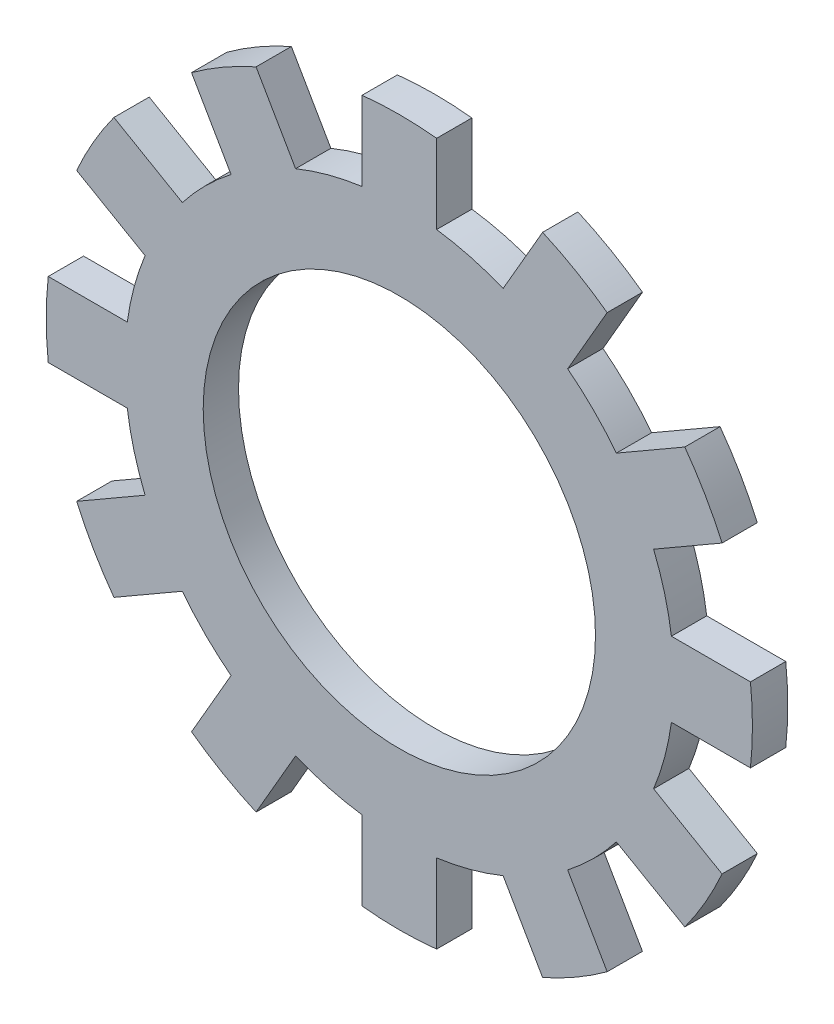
ISO-10303-21;
HEADER;
FILE_DESCRIPTION(('STEP AP214'),'2;1');
FILE_NAME('part.step','',(''),(''),'','','');
FILE_SCHEMA(('AUTOMOTIVE_DESIGN { 1 0 10303 214 1 1 1 1 }'));
ENDSEC;
DATA;
#1=APPLICATION_CONTEXT('core data for automotive mechanical design processes');
#2=APPLICATION_PROTOCOL_DEFINITION('international standard','automotive_design',2000,#1);
#3=PRODUCT_CONTEXT('',#1,'mechanical');
#4=PRODUCT('Part','Part','',(#3));
#5=PRODUCT_RELATED_PRODUCT_CATEGORY('part','',(#4));
#6=PRODUCT_DEFINITION_FORMATION('','',#4);
#7=PRODUCT_DEFINITION_CONTEXT('part definition',#1,'design');
#8=PRODUCT_DEFINITION('design','',#6,#7);
#9=PRODUCT_DEFINITION_SHAPE('','',#8);
#10=(LENGTH_UNIT() NAMED_UNIT(*) SI_UNIT(.MILLI.,.METRE.));
#11=(NAMED_UNIT(*) PLANE_ANGLE_UNIT() SI_UNIT($,.RADIAN.));
#12=(NAMED_UNIT(*) SI_UNIT($,.STERADIAN.) SOLID_ANGLE_UNIT());
#13=UNCERTAINTY_MEASURE_WITH_UNIT(LENGTH_MEASURE(1.E-05),#10,'distance_accuracy_value','');
#14=(GEOMETRIC_REPRESENTATION_CONTEXT(3) GLOBAL_UNCERTAINTY_ASSIGNED_CONTEXT((#13)) GLOBAL_UNIT_ASSIGNED_CONTEXT((#10,
#11,#12)) REPRESENTATION_CONTEXT('',''));
#15=CARTESIAN_POINT('',(0.,0.,0.));
#16=DIRECTION('',(0.,0.,1.));
#17=DIRECTION('',(1.,0.,0.));
#18=AXIS2_PLACEMENT_3D('',#15,#16,#17);
#19=CARTESIAN_POINT('',(0.,0.,0.45));
#20=DIRECTION('',(0.,0.,-1.));
#21=DIRECTION('',(-1.,0.,0.));
#22=AXIS2_PLACEMENT_3D('',#19,#20,#21);
#23=CYLINDRICAL_SURFACE('',#22,7.);
#24=CARTESIAN_POINT('',(0.,0.,-0.45));
#25=DIRECTION('',(0.,0.,1.));
#26=DIRECTION('',(1.,0.,0.));
#27=AXIS2_PLACEMENT_3D('',#24,#25,#26);
#28=CIRCLE('',#27,7.);
#29=CARTESIAN_POINT('',(5.53109065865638,4.29034219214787,-0.45));
#30=VERTEX_POINT('',#29);
#31=CARTESIAN_POINT('',(4.29034219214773,5.53109065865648,-0.45));
#32=VERTEX_POINT('',#31);
#33=EDGE_CURVE('E361',#30,#32,#28,.T.);
#34=ORIENTED_EDGE('',*,*,#33,.T.);
#35=DIRECTION('',(0.,0.,-1.));
#36=VECTOR('',#35,1.);
#37=CARTESIAN_POINT('',(4.29034219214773,5.53109065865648,0.45));
#38=LINE('',#37,#36);
#39=CARTESIAN_POINT('',(4.29034219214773,5.53109065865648,0.45));
#40=VERTEX_POINT('',#39);
#41=EDGE_CURVE('E352',#40,#32,#38,.T.);
#42=ORIENTED_EDGE('',*,*,#41,.F.);
#43=CARTESIAN_POINT('',(0.,0.,0.45));
#44=DIRECTION('',(0.,0.,1.));
#45=DIRECTION('',(1.,0.,0.));
#46=AXIS2_PLACEMENT_3D('',#43,#44,#45);
#47=CIRCLE('',#46,7.);
#48=CARTESIAN_POINT('',(5.53109065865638,4.29034219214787,0.45));
#49=VERTEX_POINT('',#48);
#50=EDGE_CURVE('E64',#49,#40,#47,.T.);
#51=ORIENTED_EDGE('',*,*,#50,.F.);
#52=DIRECTION('',(0.,0.,-1.));
#53=VECTOR('',#52,1.);
#54=CARTESIAN_POINT('',(5.53109065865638,4.29034219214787,0.45));
#55=LINE('',#54,#53);
#56=EDGE_CURVE('E626',#49,#30,#55,.T.);
#57=ORIENTED_EDGE('',*,*,#56,.T.);
#58=EDGE_LOOP('',(#34,#42,#51,#57));
#59=FACE_BOUND('',#58,.T.);
#60=ADVANCED_FACE('F39',(#59),#23,.T.);
#61=DIRECTION('',(0.,0.,-1.));
#62=VECTOR('',#61,1.);
#63=CARTESIAN_POINT('',(2.64489392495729,6.48109065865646,0.45));
#64=LINE('',#63,#62);
#65=CARTESIAN_POINT('',(2.64489392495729,6.48109065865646,0.45));
#66=VERTEX_POINT('',#65);
#67=CARTESIAN_POINT('',(2.64489392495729,6.48109065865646,-0.45));
#68=VERTEX_POINT('',#67);
#69=EDGE_CURVE('E645',#66,#68,#64,.T.);
#70=ORIENTED_EDGE('',*,*,#69,.T.);
#71=CARTESIAN_POINT('',(0.95,6.93523611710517,-0.45));
#72=VERTEX_POINT('',#71);
#73=EDGE_CURVE('E387',#68,#72,#28,.T.);
#74=ORIENTED_EDGE('',*,*,#73,.T.);
#75=DIRECTION('',(0.,0.,-1.));
#76=VECTOR('',#75,1.);
#77=CARTESIAN_POINT('',(0.95,6.93523611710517,0.45));
#78=LINE('',#77,#76);
#79=CARTESIAN_POINT('',(0.95,6.93523611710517,0.45));
#80=VERTEX_POINT('',#79);
#81=EDGE_CURVE('E404',#80,#72,#78,.T.);
#82=ORIENTED_EDGE('',*,*,#81,.F.);
#83=EDGE_CURVE('E50',#66,#80,#47,.T.);
#84=ORIENTED_EDGE('',*,*,#83,.F.);
#85=EDGE_LOOP('',(#70,#74,#82,#84));
#86=FACE_BOUND('',#85,.T.);
#87=ADVANCED_FACE('F816',(#86),#23,.T.);
#88=CARTESIAN_POINT('',(6.93523611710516,0.950000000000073,-0.45));
#89=VERTEX_POINT('',#88);
#90=CARTESIAN_POINT('',(6.4810906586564,2.64489392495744,-0.45));
#91=VERTEX_POINT('',#90);
#92=EDGE_CURVE('E905',#89,#91,#28,.T.);
#93=ORIENTED_EDGE('',*,*,#92,.T.);
#94=DIRECTION('',(0.,0.,-1.));
#95=VECTOR('',#94,1.);
#96=CARTESIAN_POINT('',(6.4810906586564,2.64489392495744,0.45));
#97=LINE('',#96,#95);
#98=CARTESIAN_POINT('',(6.4810906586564,2.64489392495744,0.45));
#99=VERTEX_POINT('',#98);
#100=EDGE_CURVE('E785',#99,#91,#97,.T.);
#101=ORIENTED_EDGE('',*,*,#100,.F.);
#102=CARTESIAN_POINT('',(6.93523611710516,0.950000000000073,0.45));
#103=VERTEX_POINT('',#102);
#104=EDGE_CURVE('E371',#103,#99,#47,.T.);
#105=ORIENTED_EDGE('',*,*,#104,.F.);
#106=DIRECTION('',(0.,0.,-1.));
#107=VECTOR('',#106,1.);
#108=CARTESIAN_POINT('',(6.93523611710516,0.950000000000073,0.45));
#109=LINE('',#108,#107);
#110=EDGE_CURVE('E605',#103,#89,#109,.T.);
#111=ORIENTED_EDGE('',*,*,#110,.T.);
#112=EDGE_LOOP('',(#93,#101,#105,#111));
#113=FACE_BOUND('',#112,.T.);
#114=ADVANCED_FACE('F903',(#113),#23,.T.);
#115=CARTESIAN_POINT('',(6.48109065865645,-2.64489392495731,-0.45));
#116=VERTEX_POINT('',#115);
#117=CARTESIAN_POINT('',(6.93523611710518,-0.949999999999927,-0.45));
#118=VERTEX_POINT('',#117);
#119=EDGE_CURVE('E886',#116,#118,#28,.T.);
#120=ORIENTED_EDGE('',*,*,#119,.T.);
#121=DIRECTION('',(0.,0.,-1.));
#122=VECTOR('',#121,1.);
#123=CARTESIAN_POINT('',(6.93523611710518,-0.949999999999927,0.45));
#124=LINE('',#123,#122);
#125=CARTESIAN_POINT('',(6.93523611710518,-0.949999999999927,0.45));
#126=VERTEX_POINT('',#125);
#127=EDGE_CURVE('E771',#126,#118,#124,.T.);
#128=ORIENTED_EDGE('',*,*,#127,.F.);
#129=CARTESIAN_POINT('',(6.48109065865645,-2.64489392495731,0.45));
#130=VERTEX_POINT('',#129);
#131=EDGE_CURVE('E376',#130,#126,#47,.T.);
#132=ORIENTED_EDGE('',*,*,#131,.F.);
#133=DIRECTION('',(0.,0.,-1.));
#134=VECTOR('',#133,1.);
#135=CARTESIAN_POINT('',(6.48109065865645,-2.64489392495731,0.45));
#136=LINE('',#135,#134);
#137=EDGE_CURVE('E583',#130,#116,#136,.T.);
#138=ORIENTED_EDGE('',*,*,#137,.T.);
#139=EDGE_LOOP('',(#120,#128,#132,#138));
#140=FACE_BOUND('',#139,.T.);
#141=ADVANCED_FACE('F885',(#140),#23,.T.);
#142=CARTESIAN_POINT('',(4.29034219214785,-5.53109065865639,-0.45));
#143=VERTEX_POINT('',#142);
#144=CARTESIAN_POINT('',(5.53109065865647,-4.29034219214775,-0.45));
#145=VERTEX_POINT('',#144);
#146=EDGE_CURVE('E965',#143,#145,#28,.T.);
#147=ORIENTED_EDGE('',*,*,#146,.T.);
#148=DIRECTION('',(0.,0.,-1.));
#149=VECTOR('',#148,1.);
#150=CARTESIAN_POINT('',(5.53109065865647,-4.29034219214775,0.45));
#151=LINE('',#150,#149);
#152=CARTESIAN_POINT('',(5.53109065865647,-4.29034219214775,0.45));
#153=VERTEX_POINT('',#152);
#154=EDGE_CURVE('E757',#153,#145,#151,.T.);
#155=ORIENTED_EDGE('',*,*,#154,.F.);
#156=CARTESIAN_POINT('',(4.29034219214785,-5.53109065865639,0.45));
#157=VERTEX_POINT('',#156);
#158=EDGE_CURVE('E872',#157,#153,#47,.T.);
#159=ORIENTED_EDGE('',*,*,#158,.F.);
#160=DIRECTION('',(0.,0.,-1.));
#161=VECTOR('',#160,1.);
#162=CARTESIAN_POINT('',(4.29034219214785,-5.53109065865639,0.45));
#163=LINE('',#162,#161);
#164=EDGE_CURVE('E561',#157,#143,#163,.T.);
#165=ORIENTED_EDGE('',*,*,#164,.T.);
#166=EDGE_LOOP('',(#147,#155,#159,#165));
#167=FACE_BOUND('',#166,.T.);
#168=ADVANCED_FACE('F974',(#167),#23,.T.);
#169=CARTESIAN_POINT('',(0.95,-6.93523611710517,-0.45));
#170=VERTEX_POINT('',#169);
#171=CARTESIAN_POINT('',(2.64489392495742,-6.48109065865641,-0.45));
#172=VERTEX_POINT('',#171);
#173=EDGE_CURVE('E960',#170,#172,#28,.T.);
#174=ORIENTED_EDGE('',*,*,#173,.T.);
#175=DIRECTION('',(0.,0.,-1.));
#176=VECTOR('',#175,1.);
#177=CARTESIAN_POINT('',(2.64489392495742,-6.48109065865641,0.45));
#178=LINE('',#177,#176);
#179=CARTESIAN_POINT('',(2.64489392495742,-6.48109065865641,0.45));
#180=VERTEX_POINT('',#179);
#181=EDGE_CURVE('E743',#180,#172,#178,.T.);
#182=ORIENTED_EDGE('',*,*,#181,.F.);
#183=CARTESIAN_POINT('',(0.95,-6.93523611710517,0.45));
#184=VERTEX_POINT('',#183);
#185=EDGE_CURVE('E868',#184,#180,#47,.T.);
#186=ORIENTED_EDGE('',*,*,#185,.F.);
#187=DIRECTION('',(0.,0.,-1.));
#188=VECTOR('',#187,1.);
#189=CARTESIAN_POINT('',(0.95,-6.93523611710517,0.45));
#190=LINE('',#189,#188);
#191=EDGE_CURVE('E539',#184,#170,#190,.T.);
#192=ORIENTED_EDGE('',*,*,#191,.T.);
#193=EDGE_LOOP('',(#174,#182,#186,#192));
#194=FACE_BOUND('',#193,.T.);
#195=ADVANCED_FACE('F1402',(#194),#23,.T.);
#196=CARTESIAN_POINT('',(-2.64489392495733,-6.48109065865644,-0.45));
#197=VERTEX_POINT('',#196);
#198=CARTESIAN_POINT('',(-0.95,-6.93523611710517,-0.45));
#199=VERTEX_POINT('',#198);
#200=EDGE_CURVE('E955',#197,#199,#28,.T.);
#201=ORIENTED_EDGE('',*,*,#200,.T.);
#202=DIRECTION('',(0.,0.,-1.));
#203=VECTOR('',#202,1.);
#204=CARTESIAN_POINT('',(-0.95,-6.93523611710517,0.45));
#205=LINE('',#204,#203);
#206=CARTESIAN_POINT('',(-0.95,-6.93523611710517,0.45));
#207=VERTEX_POINT('',#206);
#208=EDGE_CURVE('E729',#207,#199,#205,.T.);
#209=ORIENTED_EDGE('',*,*,#208,.F.);
#210=CARTESIAN_POINT('',(-2.64489392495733,-6.48109065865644,0.45));
#211=VERTEX_POINT('',#210);
#212=EDGE_CURVE('E863',#211,#207,#47,.T.);
#213=ORIENTED_EDGE('',*,*,#212,.F.);
#214=DIRECTION('',(0.,0.,-1.));
#215=VECTOR('',#214,1.);
#216=CARTESIAN_POINT('',(-2.64489392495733,-6.48109065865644,0.45));
#217=LINE('',#216,#215);
#218=EDGE_CURVE('E517',#211,#197,#217,.T.);
#219=ORIENTED_EDGE('',*,*,#218,.T.);
#220=EDGE_LOOP('',(#201,#209,#213,#219));
#221=FACE_BOUND('',#220,.T.);
#222=ADVANCED_FACE('F1394',(#221),#23,.T.);
#223=CARTESIAN_POINT('',(-5.53109065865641,-4.29034219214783,-0.45));
#224=VERTEX_POINT('',#223);
#225=CARTESIAN_POINT('',(-4.29034219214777,-5.53109065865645,-0.45));
#226=VERTEX_POINT('',#225);
#227=EDGE_CURVE('E950',#224,#226,#28,.T.);
#228=ORIENTED_EDGE('',*,*,#227,.T.);
#229=DIRECTION('',(0.,0.,-1.));
#230=VECTOR('',#229,1.);
#231=CARTESIAN_POINT('',(-4.29034219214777,-5.53109065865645,0.45));
#232=LINE('',#231,#230);
#233=CARTESIAN_POINT('',(-4.29034219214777,-5.53109065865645,0.45));
#234=VERTEX_POINT('',#233);
#235=EDGE_CURVE('E715',#234,#226,#232,.T.);
#236=ORIENTED_EDGE('',*,*,#235,.F.);
#237=CARTESIAN_POINT('',(-5.53109065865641,-4.29034219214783,0.45));
#238=VERTEX_POINT('',#237);
#239=EDGE_CURVE('E859',#238,#234,#47,.T.);
#240=ORIENTED_EDGE('',*,*,#239,.F.);
#241=DIRECTION('',(0.,0.,-1.));
#242=VECTOR('',#241,1.);
#243=CARTESIAN_POINT('',(-5.53109065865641,-4.29034219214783,0.45));
#244=LINE('',#243,#242);
#245=EDGE_CURVE('E495',#238,#224,#244,.T.);
#246=ORIENTED_EDGE('',*,*,#245,.T.);
#247=EDGE_LOOP('',(#228,#236,#240,#246));
#248=FACE_BOUND('',#247,.T.);
#249=ADVANCED_FACE('F1386',(#248),#23,.T.);
#250=CARTESIAN_POINT('',(-6.93523611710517,-0.950000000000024,-0.45));
#251=VERTEX_POINT('',#250);
#252=CARTESIAN_POINT('',(-6.48109065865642,-2.6448939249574,-0.45));
#253=VERTEX_POINT('',#252);
#254=EDGE_CURVE('E946',#251,#253,#28,.T.);
#255=ORIENTED_EDGE('',*,*,#254,.T.);
#256=DIRECTION('',(0.,0.,-1.));
#257=VECTOR('',#256,1.);
#258=CARTESIAN_POINT('',(-6.48109065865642,-2.6448939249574,0.45));
#259=LINE('',#258,#257);
#260=CARTESIAN_POINT('',(-6.48109065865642,-2.6448939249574,0.45));
#261=VERTEX_POINT('',#260);
#262=EDGE_CURVE('E701',#261,#253,#259,.T.);
#263=ORIENTED_EDGE('',*,*,#262,.F.);
#264=CARTESIAN_POINT('',(-6.93523611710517,-0.950000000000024,0.45));
#265=VERTEX_POINT('',#264);
#266=EDGE_CURVE('E854',#265,#261,#47,.T.);
#267=ORIENTED_EDGE('',*,*,#266,.F.);
#268=DIRECTION('',(0.,0.,-1.));
#269=VECTOR('',#268,1.);
#270=CARTESIAN_POINT('',(-6.93523611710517,-0.950000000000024,0.45));
#271=LINE('',#270,#269);
#272=EDGE_CURVE('E473',#265,#251,#271,.T.);
#273=ORIENTED_EDGE('',*,*,#272,.T.);
#274=EDGE_LOOP('',(#255,#263,#267,#273));
#275=FACE_BOUND('',#274,.T.);
#276=ADVANCED_FACE('F938',(#275),#23,.T.);
#277=CARTESIAN_POINT('',(-6.48109065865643,2.64489392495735,-0.45));
#278=VERTEX_POINT('',#277);
#279=CARTESIAN_POINT('',(-6.93523611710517,0.949999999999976,-0.45));
#280=VERTEX_POINT('',#279);
#281=EDGE_CURVE('E943',#278,#280,#28,.T.);
#282=ORIENTED_EDGE('',*,*,#281,.T.);
#283=DIRECTION('',(0.,0.,-1.));
#284=VECTOR('',#283,1.);
#285=CARTESIAN_POINT('',(-6.93523611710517,0.949999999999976,0.45));
#286=LINE('',#285,#284);
#287=CARTESIAN_POINT('',(-6.93523611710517,0.949999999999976,0.45));
#288=VERTEX_POINT('',#287);
#289=EDGE_CURVE('E687',#288,#280,#286,.T.);
#290=ORIENTED_EDGE('',*,*,#289,.F.);
#291=CARTESIAN_POINT('',(-6.48109065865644,2.64489392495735,0.45));
#292=VERTEX_POINT('',#291);
#293=EDGE_CURVE('E851',#292,#288,#47,.T.);
#294=ORIENTED_EDGE('',*,*,#293,.F.);
#295=DIRECTION('',(0.,0.,-1.));
#296=VECTOR('',#295,1.);
#297=CARTESIAN_POINT('',(-6.48109065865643,2.64489392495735,0.45));
#298=LINE('',#297,#296);
#299=EDGE_CURVE('E451',#292,#278,#298,.T.);
#300=ORIENTED_EDGE('',*,*,#299,.T.);
#301=EDGE_LOOP('',(#282,#290,#294,#300));
#302=FACE_BOUND('',#301,.T.);
#303=ADVANCED_FACE('F934',(#302),#23,.T.);
#304=CARTESIAN_POINT('',(-4.29034219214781,5.53109065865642,-0.45));
#305=VERTEX_POINT('',#304);
#306=CARTESIAN_POINT('',(-5.53109065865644,4.29034219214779,-0.45));
#307=VERTEX_POINT('',#306);
#308=EDGE_CURVE('E941',#305,#307,#28,.T.);
#309=ORIENTED_EDGE('',*,*,#308,.T.);
#310=DIRECTION('',(0.,0.,-1.));
#311=VECTOR('',#310,1.);
#312=CARTESIAN_POINT('',(-5.53109065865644,4.29034219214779,0.45));
#313=LINE('',#312,#311);
#314=CARTESIAN_POINT('',(-5.53109065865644,4.29034219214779,0.45));
#315=VERTEX_POINT('',#314);
#316=EDGE_CURVE('E673',#315,#307,#313,.T.);
#317=ORIENTED_EDGE('',*,*,#316,.F.);
#318=CARTESIAN_POINT('',(-4.29034219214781,5.53109065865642,0.45));
#319=VERTEX_POINT('',#318);
#320=EDGE_CURVE('E49',#319,#315,#47,.T.);
#321=ORIENTED_EDGE('',*,*,#320,.F.);
#322=DIRECTION('',(0.,0.,-1.));
#323=VECTOR('',#322,1.);
#324=CARTESIAN_POINT('',(-4.29034219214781,5.53109065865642,0.45));
#325=LINE('',#324,#323);
#326=EDGE_CURVE('E429',#319,#305,#325,.T.);
#327=ORIENTED_EDGE('',*,*,#326,.T.);
#328=EDGE_LOOP('',(#309,#317,#321,#327));
#329=FACE_BOUND('',#328,.T.);
#330=ADVANCED_FACE('F928',(#329),#23,.T.);
#331=CARTESIAN_POINT('',(-0.95,6.93523611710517,-0.45));
#332=VERTEX_POINT('',#331);
#333=CARTESIAN_POINT('',(-2.64489392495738,6.48109065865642,-0.45));
#334=VERTEX_POINT('',#333);
#335=EDGE_CURVE('E43',#332,#334,#28,.T.);
#336=ORIENTED_EDGE('',*,*,#335,.T.);
#337=DIRECTION('',(0.,0.,-1.));
#338=VECTOR('',#337,1.);
#339=CARTESIAN_POINT('',(-2.64489392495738,6.48109065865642,0.45));
#340=LINE('',#339,#338);
#341=CARTESIAN_POINT('',(-2.64489392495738,6.48109065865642,0.45));
#342=VERTEX_POINT('',#341);
#343=EDGE_CURVE('E657',#342,#334,#340,.T.);
#344=ORIENTED_EDGE('',*,*,#343,.F.);
#345=CARTESIAN_POINT('',(-0.95,6.93523611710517,0.45));
#346=VERTEX_POINT('',#345);
#347=EDGE_CURVE('E11',#346,#342,#47,.T.);
#348=ORIENTED_EDGE('',*,*,#347,.F.);
#349=DIRECTION('',(0.,0.,-1.));
#350=VECTOR('',#349,1.);
#351=CARTESIAN_POINT('',(-0.95,6.93523611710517,0.45));
#352=LINE('',#351,#350);
#353=EDGE_CURVE('E391',#346,#332,#352,.T.);
#354=ORIENTED_EDGE('',*,*,#353,.T.);
#355=EDGE_LOOP('',(#336,#344,#348,#354));
#356=FACE_BOUND('',#355,.T.);
#357=ADVANCED_FACE('F41',(#356),#23,.T.);
#358=CARTESIAN_POINT('',(0.,0.,0.45));
#359=DIRECTION('',(0.,0.,1.));
#360=DIRECTION('',(1.,0.,0.));
#361=AXIS2_PLACEMENT_3D('',#358,#359,#360);
#362=PLANE('',#361);
#363=ORIENTED_EDGE('',*,*,#347,.T.);
#364=DIRECTION('',(0.500000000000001,-0.866025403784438,0.));
#365=VECTOR('',#364,1.);
#366=CARTESIAN_POINT('',(-3.65213619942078,8.22568545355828,0.45));
#367=LINE('',#366,#365);
#368=CARTESIAN_POINT('',(-3.65213619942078,8.22568545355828,0.45));
#369=VERTEX_POINT('',#368);
#370=EDGE_CURVE('E668',#369,#342,#367,.T.);
#371=ORIENTED_EDGE('',*,*,#370,.F.);
#372=CARTESIAN_POINT('',(0.,0.,0.45));
#373=DIRECTION('',(0.,0.,1.));
#374=DIRECTION('',(0.866025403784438,0.500000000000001,0.));
#375=AXIS2_PLACEMENT_3D('',#372,#373,#374);
#376=CIRCLE('',#375,9.);
#377=CARTESIAN_POINT('',(-5.29758446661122,7.27568545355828,0.45));
#378=VERTEX_POINT('',#377);
#379=EDGE_CURVE('E438',#369,#378,#376,.T.);
#380=ORIENTED_EDGE('',*,*,#379,.T.);
#381=DIRECTION('',(0.500000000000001,-0.866025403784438,0.));
#382=VECTOR('',#381,1.);
#383=CARTESIAN_POINT('',(-5.29758446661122,7.27568545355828,0.45));
#384=LINE('',#383,#382);
#385=EDGE_CURVE('E433',#378,#319,#384,.T.);
#386=ORIENTED_EDGE('',*,*,#385,.T.);
#387=ORIENTED_EDGE('',*,*,#320,.T.);
#388=DIRECTION('',(0.86602540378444,-0.499999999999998,0.));
#389=VECTOR('',#388,1.);
#390=CARTESIAN_POINT('',(-7.2756854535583,5.29758446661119,0.45));
#391=LINE('',#390,#389);
#392=CARTESIAN_POINT('',(-7.2756854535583,5.29758446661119,0.45));
#393=VERTEX_POINT('',#392);
#394=EDGE_CURVE('E682',#393,#315,#391,.T.);
#395=ORIENTED_EDGE('',*,*,#394,.F.);
#396=CARTESIAN_POINT('',(0.,0.,0.45));
#397=DIRECTION('',(0.,0.,1.));
#398=DIRECTION('',(0.499999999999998,0.86602540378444,0.));
#399=AXIS2_PLACEMENT_3D('',#396,#397,#398);
#400=CIRCLE('',#399,9.);
#401=CARTESIAN_POINT('',(-8.22568545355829,3.65213619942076,0.45));
#402=VERTEX_POINT('',#401);
#403=EDGE_CURVE('E460',#393,#402,#400,.T.);
#404=ORIENTED_EDGE('',*,*,#403,.T.);
#405=DIRECTION('',(0.86602540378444,-0.499999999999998,0.));
#406=VECTOR('',#405,1.);
#407=CARTESIAN_POINT('',(-8.22568545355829,3.65213619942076,0.45));
#408=LINE('',#407,#406);
#409=EDGE_CURVE('E455',#402,#292,#408,.T.);
#410=ORIENTED_EDGE('',*,*,#409,.T.);
#411=ORIENTED_EDGE('',*,*,#293,.T.);
#412=DIRECTION('',(1.,0.,0.));
#413=VECTOR('',#412,1.);
#414=CARTESIAN_POINT('',(-8.94972066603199,0.949999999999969,0.45));
#415=LINE('',#414,#413);
#416=CARTESIAN_POINT('',(-8.94972066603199,0.949999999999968,0.45));
#417=VERTEX_POINT('',#416);
#418=EDGE_CURVE('E696',#417,#288,#415,.T.);
#419=ORIENTED_EDGE('',*,*,#418,.F.);
#420=CARTESIAN_POINT('',(0.,0.,0.45));
#421=DIRECTION('',(0.,0.,1.));
#422=DIRECTION('',(0.,1.,0.));
#423=AXIS2_PLACEMENT_3D('',#420,#421,#422);
#424=CIRCLE('',#423,9.);
#425=CARTESIAN_POINT('',(-8.94972066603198,-0.950000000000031,0.45));
#426=VERTEX_POINT('',#425);
#427=EDGE_CURVE('E482',#417,#426,#424,.T.);
#428=ORIENTED_EDGE('',*,*,#427,.T.);
#429=DIRECTION('',(1.,0.,0.));
#430=VECTOR('',#429,1.);
#431=CARTESIAN_POINT('',(-8.94972066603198,-0.950000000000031,0.45));
#432=LINE('',#431,#430);
#433=EDGE_CURVE('E477',#426,#265,#432,.T.);
#434=ORIENTED_EDGE('',*,*,#433,.T.);
#435=ORIENTED_EDGE('',*,*,#266,.T.);
#436=DIRECTION('',(0.866025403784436,0.500000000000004,0.));
#437=VECTOR('',#436,1.);
#438=CARTESIAN_POINT('',(-8.22568545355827,-3.65213619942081,0.45));
#439=LINE('',#438,#437);
#440=CARTESIAN_POINT('',(-8.22568545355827,-3.65213619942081,0.45));
#441=VERTEX_POINT('',#440);
#442=EDGE_CURVE('E710',#441,#261,#439,.T.);
#443=ORIENTED_EDGE('',*,*,#442,.F.);
#444=CARTESIAN_POINT('',(0.,0.,0.45));
#445=DIRECTION('',(0.,0.,1.));
#446=DIRECTION('',(-0.500000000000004,0.866025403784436,0.));
#447=AXIS2_PLACEMENT_3D('',#444,#445,#446);
#448=CIRCLE('',#447,9.);
#449=CARTESIAN_POINT('',(-7.27568545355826,-5.29758446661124,0.45));
#450=VERTEX_POINT('',#449);
#451=EDGE_CURVE('E504',#441,#450,#448,.T.);
#452=ORIENTED_EDGE('',*,*,#451,.T.);
#453=DIRECTION('',(0.866025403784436,0.500000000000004,0.));
#454=VECTOR('',#453,1.);
#455=CARTESIAN_POINT('',(-7.27568545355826,-5.29758446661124,0.45));
#456=LINE('',#455,#454);
#457=EDGE_CURVE('E499',#450,#238,#456,.T.);
#458=ORIENTED_EDGE('',*,*,#457,.T.);
#459=ORIENTED_EDGE('',*,*,#239,.T.);
#460=DIRECTION('',(0.499999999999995,0.866025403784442,0.));
#461=VECTOR('',#460,1.);
#462=CARTESIAN_POINT('',(-5.29758446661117,-7.27568545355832,0.45));
#463=LINE('',#462,#461);
#464=CARTESIAN_POINT('',(-5.29758446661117,-7.27568545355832,0.45));
#465=VERTEX_POINT('',#464);
#466=EDGE_CURVE('E724',#465,#234,#463,.T.);
#467=ORIENTED_EDGE('',*,*,#466,.F.);
#468=CARTESIAN_POINT('',(0.,0.,0.45));
#469=DIRECTION('',(0.,0.,1.));
#470=DIRECTION('',(-0.866025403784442,0.499999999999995,0.));
#471=AXIS2_PLACEMENT_3D('',#468,#469,#470);
#472=CIRCLE('',#471,9.);
#473=CARTESIAN_POINT('',(-3.65213619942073,-8.22568545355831,0.45));
#474=VERTEX_POINT('',#473);
#475=EDGE_CURVE('E526',#465,#474,#472,.T.);
#476=ORIENTED_EDGE('',*,*,#475,.T.);
#477=DIRECTION('',(0.499999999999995,0.866025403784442,0.));
#478=VECTOR('',#477,1.);
#479=CARTESIAN_POINT('',(-3.65213619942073,-8.22568545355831,0.45));
#480=LINE('',#479,#478);
#481=EDGE_CURVE('E521',#474,#211,#480,.T.);
#482=ORIENTED_EDGE('',*,*,#481,.T.);
#483=ORIENTED_EDGE('',*,*,#212,.T.);
#484=DIRECTION('',(0.,1.,0.));
#485=VECTOR('',#484,1.);
#486=CARTESIAN_POINT('',(-0.95,-8.94972066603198,0.45));
#487=LINE('',#486,#485);
#488=CARTESIAN_POINT('',(-0.95,-8.94972066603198,0.45));
#489=VERTEX_POINT('',#488);
#490=EDGE_CURVE('E738',#489,#207,#487,.T.);
#491=ORIENTED_EDGE('',*,*,#490,.F.);
#492=CARTESIAN_POINT('',(0.,0.,0.45));
#493=DIRECTION('',(0.,0.,1.));
#494=DIRECTION('',(-1.,0.,0.));
#495=AXIS2_PLACEMENT_3D('',#492,#493,#494);
#496=CIRCLE('',#495,9.);
#497=CARTESIAN_POINT('',(0.95,-8.94972066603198,0.45));
#498=VERTEX_POINT('',#497);
#499=EDGE_CURVE('E548',#489,#498,#496,.T.);
#500=ORIENTED_EDGE('',*,*,#499,.T.);
#501=DIRECTION('',(0.,1.,0.));
#502=VECTOR('',#501,1.);
#503=CARTESIAN_POINT('',(0.95,-8.94972066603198,0.45));
#504=LINE('',#503,#502);
#505=EDGE_CURVE('E543',#498,#184,#504,.T.);
#506=ORIENTED_EDGE('',*,*,#505,.T.);
#507=ORIENTED_EDGE('',*,*,#185,.T.);
#508=DIRECTION('',(-0.500000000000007,0.866025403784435,0.));
#509=VECTOR('',#508,1.);
#510=CARTESIAN_POINT('',(3.65213619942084,-8.22568545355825,0.45));
#511=LINE('',#510,#509);
#512=CARTESIAN_POINT('',(3.65213619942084,-8.22568545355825,0.45));
#513=VERTEX_POINT('',#512);
#514=EDGE_CURVE('E752',#513,#180,#511,.T.);
#515=ORIENTED_EDGE('',*,*,#514,.F.);
#516=CARTESIAN_POINT('',(0.,0.,0.45));
#517=DIRECTION('',(0.,0.,1.));
#518=DIRECTION('',(-0.866025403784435,-0.500000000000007,0.));
#519=AXIS2_PLACEMENT_3D('',#516,#517,#518);
#520=CIRCLE('',#519,9.);
#521=CARTESIAN_POINT('',(5.29758446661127,-7.27568545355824,0.45));
#522=VERTEX_POINT('',#521);
#523=EDGE_CURVE('E570',#513,#522,#520,.T.);
#524=ORIENTED_EDGE('',*,*,#523,.T.);
#525=DIRECTION('',(-0.500000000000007,0.866025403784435,0.));
#526=VECTOR('',#525,1.);
#527=CARTESIAN_POINT('',(5.29758446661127,-7.27568545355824,0.45));
#528=LINE('',#527,#526);
#529=EDGE_CURVE('E565',#522,#157,#528,.T.);
#530=ORIENTED_EDGE('',*,*,#529,.T.);
#531=ORIENTED_EDGE('',*,*,#158,.T.);
#532=DIRECTION('',(-0.866025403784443,0.499999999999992,0.));
#533=VECTOR('',#532,1.);
#534=CARTESIAN_POINT('',(7.27568545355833,-5.29758446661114,0.45));
#535=LINE('',#534,#533);
#536=CARTESIAN_POINT('',(7.27568545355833,-5.29758446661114,0.45));
#537=VERTEX_POINT('',#536);
#538=EDGE_CURVE('E766',#537,#153,#535,.T.);
#539=ORIENTED_EDGE('',*,*,#538,.F.);
#540=CARTESIAN_POINT('',(0.,0.,0.45));
#541=DIRECTION('',(0.,0.,1.));
#542=DIRECTION('',(-0.499999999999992,-0.866025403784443,0.));
#543=AXIS2_PLACEMENT_3D('',#540,#541,#542);
#544=CIRCLE('',#543,9.);
#545=CARTESIAN_POINT('',(8.22568545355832,-3.6521361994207,0.45));
#546=VERTEX_POINT('',#545);
#547=EDGE_CURVE('E592',#537,#546,#544,.T.);
#548=ORIENTED_EDGE('',*,*,#547,.T.);
#549=DIRECTION('',(-0.866025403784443,0.499999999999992,0.));
#550=VECTOR('',#549,1.);
#551=CARTESIAN_POINT('',(8.22568545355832,-3.6521361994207,0.45));
#552=LINE('',#551,#550);
#553=EDGE_CURVE('E587',#546,#130,#552,.T.);
#554=ORIENTED_EDGE('',*,*,#553,.T.);
#555=ORIENTED_EDGE('',*,*,#131,.T.);
#556=DIRECTION('',(-1.,0.,0.));
#557=VECTOR('',#556,1.);
#558=CARTESIAN_POINT('',(8.949720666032,-0.949999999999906,0.45));
#559=LINE('',#558,#557);
#560=CARTESIAN_POINT('',(8.949720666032,-0.949999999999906,0.45));
#561=VERTEX_POINT('',#560);
#562=EDGE_CURVE('E780',#561,#126,#559,.T.);
#563=ORIENTED_EDGE('',*,*,#562,.F.);
#564=CARTESIAN_POINT('',(0.,0.,0.45));
#565=DIRECTION('',(0.,0.,1.));
#566=DIRECTION('',(0.,-1.,0.));
#567=AXIS2_PLACEMENT_3D('',#564,#565,#566);
#568=CIRCLE('',#567,9.);
#569=CARTESIAN_POINT('',(8.94972066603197,0.950000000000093,0.45));
#570=VERTEX_POINT('',#569);
#571=EDGE_CURVE('E613',#561,#570,#568,.T.);
#572=ORIENTED_EDGE('',*,*,#571,.T.);
#573=DIRECTION('',(-1.,0.,0.));
#574=VECTOR('',#573,1.);
#575=CARTESIAN_POINT('',(8.94972066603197,0.950000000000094,0.45));
#576=LINE('',#575,#574);
#577=EDGE_CURVE('E609',#570,#103,#576,.T.);
#578=ORIENTED_EDGE('',*,*,#577,.T.);
#579=ORIENTED_EDGE('',*,*,#104,.T.);
#580=DIRECTION('',(-0.866025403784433,-0.50000000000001,0.));
#581=VECTOR('',#580,1.);
#582=CARTESIAN_POINT('',(8.22568545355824,3.65213619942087,0.45));
#583=LINE('',#582,#581);
#584=CARTESIAN_POINT('',(8.22568545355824,3.65213619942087,0.45));
#585=VERTEX_POINT('',#584);
#586=EDGE_CURVE('E794',#585,#99,#583,.T.);
#587=ORIENTED_EDGE('',*,*,#586,.F.);
#588=CARTESIAN_POINT('',(0.,0.,0.45));
#589=DIRECTION('',(0.,0.,1.));
#590=DIRECTION('',(0.50000000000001,-0.866025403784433,0.));
#591=AXIS2_PLACEMENT_3D('',#588,#589,#590);
#592=CIRCLE('',#591,9.);
#593=CARTESIAN_POINT('',(7.27568545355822,5.29758446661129,0.45));
#594=VERTEX_POINT('',#593);
#595=EDGE_CURVE('E633',#585,#594,#592,.T.);
#596=ORIENTED_EDGE('',*,*,#595,.T.);
#597=DIRECTION('',(-0.866025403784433,-0.50000000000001,0.));
#598=VECTOR('',#597,1.);
#599=CARTESIAN_POINT('',(7.27568545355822,5.29758446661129,0.45));
#600=LINE('',#599,#598);
#601=EDGE_CURVE('E368',#594,#49,#600,.T.);
#602=ORIENTED_EDGE('',*,*,#601,.T.);
#603=ORIENTED_EDGE('',*,*,#50,.T.);
#604=DIRECTION('',(-0.499999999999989,-0.866025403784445,0.));
#605=VECTOR('',#604,1.);
#606=CARTESIAN_POINT('',(5.29758446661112,7.27568545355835,0.45));
#607=LINE('',#606,#605);
#608=CARTESIAN_POINT('',(5.29758446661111,7.27568545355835,0.45));
#609=VERTEX_POINT('',#608);
#610=EDGE_CURVE('E349',#609,#40,#607,.T.);
#611=ORIENTED_EDGE('',*,*,#610,.F.);
#612=CARTESIAN_POINT('',(0.,0.,0.45));
#613=DIRECTION('',(0.,0.,1.));
#614=DIRECTION('',(0.866025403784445,-0.499999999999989,0.));
#615=AXIS2_PLACEMENT_3D('',#612,#613,#614);
#616=CIRCLE('',#615,9.);
#617=CARTESIAN_POINT('',(3.65213619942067,8.22568545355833,0.45));
#618=VERTEX_POINT('',#617);
#619=EDGE_CURVE('E653',#609,#618,#616,.T.);
#620=ORIENTED_EDGE('',*,*,#619,.T.);
#621=DIRECTION('',(-0.499999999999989,-0.866025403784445,0.));
#622=VECTOR('',#621,1.);
#623=CARTESIAN_POINT('',(3.65213619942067,8.22568545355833,0.45));
#624=LINE('',#623,#622);
#625=EDGE_CURVE('E648',#618,#66,#624,.T.);
#626=ORIENTED_EDGE('',*,*,#625,.T.);
#627=ORIENTED_EDGE('',*,*,#83,.T.);
#628=DIRECTION('',(0.,-1.,0.));
#629=VECTOR('',#628,1.);
#630=CARTESIAN_POINT('',(0.95,8.94972066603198,0.45));
#631=LINE('',#630,#629);
#632=CARTESIAN_POINT('',(0.95,8.94972066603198,0.45));
#633=VERTEX_POINT('',#632);
#634=EDGE_CURVE('E417',#633,#80,#631,.T.);
#635=ORIENTED_EDGE('',*,*,#634,.F.);
#636=CARTESIAN_POINT('',(0.,0.,0.45));
#637=DIRECTION('',(0.,0.,1.));
#638=DIRECTION('',(1.,0.,0.));
#639=AXIS2_PLACEMENT_3D('',#636,#637,#638);
#640=CIRCLE('',#639,9.);
#641=CARTESIAN_POINT('',(-0.95,8.94972066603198,0.45));
#642=VERTEX_POINT('',#641);
#643=EDGE_CURVE('E400',#633,#642,#640,.T.);
#644=ORIENTED_EDGE('',*,*,#643,.T.);
#645=DIRECTION('',(0.,-1.,0.));
#646=VECTOR('',#645,1.);
#647=CARTESIAN_POINT('',(-0.95,8.94972066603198,0.45));
#648=LINE('',#647,#646);
#649=EDGE_CURVE('E395',#642,#346,#648,.T.);
#650=ORIENTED_EDGE('',*,*,#649,.T.);
#651=EDGE_LOOP('',(#363,#371,#380,#386,#387,#395,#404,#410,#411,#419,#428,#434,#435,#443,#452,
#458,#459,#467,#476,#482,#483,#491,#500,#506,#507,#515,#524,#530,#531,#539,#548,#554,#555,#563,
#572,#578,#579,#587,#596,#602,#603,#611,#620,#626,#627,#635,#644,#650));
#652=FACE_BOUND('',#651,.T.);
#653=CARTESIAN_POINT('',(0.,0.,0.45));
#654=DIRECTION('',(0.,0.,1.));
#655=DIRECTION('',(1.,0.,0.));
#656=AXIS2_PLACEMENT_3D('',#653,#654,#655);
#657=CIRCLE('',#656,5.);
#658=CARTESIAN_POINT('',(5.,0.,0.45));
#659=VERTEX_POINT('',#658);
#660=EDGE_CURVE('E382',#659,#659,#657,.T.);
#661=ORIENTED_EDGE('',*,*,#660,.F.);
#662=EDGE_LOOP('',(#661));
#663=FACE_BOUND('',#662,.T.);
#664=ADVANCED_FACE('F365',(#652,#663),#362,.T.);
#665=CARTESIAN_POINT('',(0.,0.,-0.45));
#666=DIRECTION('',(0.,0.,1.));
#667=DIRECTION('',(1.,0.,0.));
#668=AXIS2_PLACEMENT_3D('',#665,#666,#667);
#669=PLANE('',#668);
#670=ORIENTED_EDGE('',*,*,#335,.F.);
#671=DIRECTION('',(0.,-1.,0.));
#672=VECTOR('',#671,1.);
#673=CARTESIAN_POINT('',(-0.95,8.94972066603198,-0.45));
#674=LINE('',#673,#672);
#675=CARTESIAN_POINT('',(-0.95,8.94972066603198,-0.45));
#676=VERTEX_POINT('',#675);
#677=EDGE_CURVE('E396',#676,#332,#674,.T.);
#678=ORIENTED_EDGE('',*,*,#677,.F.);
#679=CARTESIAN_POINT('',(0.,0.,-0.45));
#680=DIRECTION('',(0.,0.,1.));
#681=DIRECTION('',(1.,0.,0.));
#682=AXIS2_PLACEMENT_3D('',#679,#680,#681);
#683=CIRCLE('',#682,9.);
#684=CARTESIAN_POINT('',(0.95,8.94972066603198,-0.45));
#685=VERTEX_POINT('',#684);
#686=EDGE_CURVE('E401',#685,#676,#683,.T.);
#687=ORIENTED_EDGE('',*,*,#686,.F.);
#688=DIRECTION('',(0.,-1.,0.));
#689=VECTOR('',#688,1.);
#690=CARTESIAN_POINT('',(0.95,8.94972066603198,-0.45));
#691=LINE('',#690,#689);
#692=EDGE_CURVE('E418',#685,#72,#691,.T.);
#693=ORIENTED_EDGE('',*,*,#692,.T.);
#694=ORIENTED_EDGE('',*,*,#73,.F.);
#695=DIRECTION('',(-0.499999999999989,-0.866025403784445,0.));
#696=VECTOR('',#695,1.);
#697=CARTESIAN_POINT('',(3.65213619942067,8.22568545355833,-0.45));
#698=LINE('',#697,#696);
#699=CARTESIAN_POINT('',(3.65213619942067,8.22568545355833,-0.45));
#700=VERTEX_POINT('',#699);
#701=EDGE_CURVE('E649',#700,#68,#698,.T.);
#702=ORIENTED_EDGE('',*,*,#701,.F.);
#703=CARTESIAN_POINT('',(0.,0.,-0.45));
#704=DIRECTION('',(0.,0.,1.));
#705=DIRECTION('',(0.866025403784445,-0.499999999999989,0.));
#706=AXIS2_PLACEMENT_3D('',#703,#704,#705);
#707=CIRCLE('',#706,9.);
#708=CARTESIAN_POINT('',(5.29758446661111,7.27568545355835,-0.45));
#709=VERTEX_POINT('',#708);
#710=EDGE_CURVE('E654',#709,#700,#707,.T.);
#711=ORIENTED_EDGE('',*,*,#710,.F.);
#712=DIRECTION('',(-0.499999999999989,-0.866025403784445,0.));
#713=VECTOR('',#712,1.);
#714=CARTESIAN_POINT('',(5.29758446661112,7.27568545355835,-0.45));
#715=LINE('',#714,#713);
#716=EDGE_CURVE('E358',#709,#32,#715,.T.);
#717=ORIENTED_EDGE('',*,*,#716,.T.);
#718=ORIENTED_EDGE('',*,*,#33,.F.);
#719=DIRECTION('',(-0.866025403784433,-0.50000000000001,0.));
#720=VECTOR('',#719,1.);
#721=CARTESIAN_POINT('',(7.27568545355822,5.29758446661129,-0.45));
#722=LINE('',#721,#720);
#723=CARTESIAN_POINT('',(7.27568545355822,5.29758446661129,-0.45));
#724=VERTEX_POINT('',#723);
#725=EDGE_CURVE('E629',#724,#30,#722,.T.);
#726=ORIENTED_EDGE('',*,*,#725,.F.);
#727=CARTESIAN_POINT('',(0.,0.,-0.45));
#728=DIRECTION('',(0.,0.,1.));
#729=DIRECTION('',(0.50000000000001,-0.866025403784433,0.));
#730=AXIS2_PLACEMENT_3D('',#727,#728,#729);
#731=CIRCLE('',#730,9.);
#732=CARTESIAN_POINT('',(8.22568545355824,3.65213619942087,-0.45));
#733=VERTEX_POINT('',#732);
#734=EDGE_CURVE('E634',#733,#724,#731,.T.);
#735=ORIENTED_EDGE('',*,*,#734,.F.);
#736=DIRECTION('',(-0.866025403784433,-0.50000000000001,0.));
#737=VECTOR('',#736,1.);
#738=CARTESIAN_POINT('',(8.22568545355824,3.65213619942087,-0.45));
#739=LINE('',#738,#737);
#740=EDGE_CURVE('E363',#733,#91,#739,.T.);
#741=ORIENTED_EDGE('',*,*,#740,.T.);
#742=ORIENTED_EDGE('',*,*,#92,.F.);
#743=DIRECTION('',(-1.,0.,0.));
#744=VECTOR('',#743,1.);
#745=CARTESIAN_POINT('',(8.94972066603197,0.950000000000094,-0.45));
#746=LINE('',#745,#744);
#747=CARTESIAN_POINT('',(8.94972066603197,0.950000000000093,-0.45));
#748=VERTEX_POINT('',#747);
#749=EDGE_CURVE('E610',#748,#89,#746,.T.);
#750=ORIENTED_EDGE('',*,*,#749,.F.);
#751=CARTESIAN_POINT('',(0.,0.,-0.45));
#752=DIRECTION('',(0.,0.,1.));
#753=DIRECTION('',(0.,-1.,0.));
#754=AXIS2_PLACEMENT_3D('',#751,#752,#753);
#755=CIRCLE('',#754,9.);
#756=CARTESIAN_POINT('',(8.949720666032,-0.949999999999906,-0.45));
#757=VERTEX_POINT('',#756);
#758=EDGE_CURVE('E614',#757,#748,#755,.T.);
#759=ORIENTED_EDGE('',*,*,#758,.F.);
#760=DIRECTION('',(-1.,0.,0.));
#761=VECTOR('',#760,1.);
#762=CARTESIAN_POINT('',(8.949720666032,-0.949999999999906,-0.45));
#763=LINE('',#762,#761);
#764=EDGE_CURVE('E781',#757,#118,#763,.T.);
#765=ORIENTED_EDGE('',*,*,#764,.T.);
#766=ORIENTED_EDGE('',*,*,#119,.F.);
#767=DIRECTION('',(-0.866025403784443,0.499999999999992,0.));
#768=VECTOR('',#767,1.);
#769=CARTESIAN_POINT('',(8.22568545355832,-3.6521361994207,-0.45));
#770=LINE('',#769,#768);
#771=CARTESIAN_POINT('',(8.22568545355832,-3.6521361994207,-0.45));
#772=VERTEX_POINT('',#771);
#773=EDGE_CURVE('E588',#772,#116,#770,.T.);
#774=ORIENTED_EDGE('',*,*,#773,.F.);
#775=CARTESIAN_POINT('',(0.,0.,-0.45));
#776=DIRECTION('',(0.,0.,1.));
#777=DIRECTION('',(-0.499999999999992,-0.866025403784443,0.));
#778=AXIS2_PLACEMENT_3D('',#775,#776,#777);
#779=CIRCLE('',#778,9.);
#780=CARTESIAN_POINT('',(7.27568545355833,-5.29758446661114,-0.45));
#781=VERTEX_POINT('',#780);
#782=EDGE_CURVE('E593',#781,#772,#779,.T.);
#783=ORIENTED_EDGE('',*,*,#782,.F.);
#784=DIRECTION('',(-0.866025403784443,0.499999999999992,0.));
#785=VECTOR('',#784,1.);
#786=CARTESIAN_POINT('',(7.27568545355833,-5.29758446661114,-0.45));
#787=LINE('',#786,#785);
#788=EDGE_CURVE('E767',#781,#145,#787,.T.);
#789=ORIENTED_EDGE('',*,*,#788,.T.);
#790=ORIENTED_EDGE('',*,*,#146,.F.);
#791=DIRECTION('',(-0.500000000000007,0.866025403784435,0.));
#792=VECTOR('',#791,1.);
#793=CARTESIAN_POINT('',(5.29758446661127,-7.27568545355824,-0.45));
#794=LINE('',#793,#792);
#795=CARTESIAN_POINT('',(5.29758446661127,-7.27568545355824,-0.45));
#796=VERTEX_POINT('',#795);
#797=EDGE_CURVE('E566',#796,#143,#794,.T.);
#798=ORIENTED_EDGE('',*,*,#797,.F.);
#799=CARTESIAN_POINT('',(0.,0.,-0.45));
#800=DIRECTION('',(0.,0.,1.));
#801=DIRECTION('',(-0.866025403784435,-0.500000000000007,0.));
#802=AXIS2_PLACEMENT_3D('',#799,#800,#801);
#803=CIRCLE('',#802,9.);
#804=CARTESIAN_POINT('',(3.65213619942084,-8.22568545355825,-0.45));
#805=VERTEX_POINT('',#804);
#806=EDGE_CURVE('E571',#805,#796,#803,.T.);
#807=ORIENTED_EDGE('',*,*,#806,.F.);
#808=DIRECTION('',(-0.500000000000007,0.866025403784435,0.));
#809=VECTOR('',#808,1.);
#810=CARTESIAN_POINT('',(3.65213619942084,-8.22568545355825,-0.45));
#811=LINE('',#810,#809);
#812=EDGE_CURVE('E753',#805,#172,#811,.T.);
#813=ORIENTED_EDGE('',*,*,#812,.T.);
#814=ORIENTED_EDGE('',*,*,#173,.F.);
#815=DIRECTION('',(0.,1.,0.));
#816=VECTOR('',#815,1.);
#817=CARTESIAN_POINT('',(0.95,-8.94972066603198,-0.45));
#818=LINE('',#817,#816);
#819=CARTESIAN_POINT('',(0.95,-8.94972066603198,-0.45));
#820=VERTEX_POINT('',#819);
#821=EDGE_CURVE('E544',#820,#170,#818,.T.);
#822=ORIENTED_EDGE('',*,*,#821,.F.);
#823=CARTESIAN_POINT('',(0.,0.,-0.45));
#824=DIRECTION('',(0.,0.,1.));
#825=DIRECTION('',(-1.,0.,0.));
#826=AXIS2_PLACEMENT_3D('',#823,#824,#825);
#827=CIRCLE('',#826,9.);
#828=CARTESIAN_POINT('',(-0.95,-8.94972066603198,-0.45));
#829=VERTEX_POINT('',#828);
#830=EDGE_CURVE('E549',#829,#820,#827,.T.);
#831=ORIENTED_EDGE('',*,*,#830,.F.);
#832=DIRECTION('',(0.,1.,0.));
#833=VECTOR('',#832,1.);
#834=CARTESIAN_POINT('',(-0.95,-8.94972066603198,-0.45));
#835=LINE('',#834,#833);
#836=EDGE_CURVE('E739',#829,#199,#835,.T.);
#837=ORIENTED_EDGE('',*,*,#836,.T.);
#838=ORIENTED_EDGE('',*,*,#200,.F.);
#839=DIRECTION('',(0.499999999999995,0.866025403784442,0.));
#840=VECTOR('',#839,1.);
#841=CARTESIAN_POINT('',(-3.65213619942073,-8.22568545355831,-0.45));
#842=LINE('',#841,#840);
#843=CARTESIAN_POINT('',(-3.65213619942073,-8.22568545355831,-0.45));
#844=VERTEX_POINT('',#843);
#845=EDGE_CURVE('E522',#844,#197,#842,.T.);
#846=ORIENTED_EDGE('',*,*,#845,.F.);
#847=CARTESIAN_POINT('',(0.,0.,-0.45));
#848=DIRECTION('',(0.,0.,1.));
#849=DIRECTION('',(-0.866025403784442,0.499999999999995,0.));
#850=AXIS2_PLACEMENT_3D('',#847,#848,#849);
#851=CIRCLE('',#850,9.);
#852=CARTESIAN_POINT('',(-5.29758446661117,-7.27568545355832,-0.45));
#853=VERTEX_POINT('',#852);
#854=EDGE_CURVE('E527',#853,#844,#851,.T.);
#855=ORIENTED_EDGE('',*,*,#854,.F.);
#856=DIRECTION('',(0.499999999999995,0.866025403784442,0.));
#857=VECTOR('',#856,1.);
#858=CARTESIAN_POINT('',(-5.29758446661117,-7.27568545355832,-0.45));
#859=LINE('',#858,#857);
#860=EDGE_CURVE('E725',#853,#226,#859,.T.);
#861=ORIENTED_EDGE('',*,*,#860,.T.);
#862=ORIENTED_EDGE('',*,*,#227,.F.);
#863=DIRECTION('',(0.866025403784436,0.500000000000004,0.));
#864=VECTOR('',#863,1.);
#865=CARTESIAN_POINT('',(-7.27568545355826,-5.29758446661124,-0.45));
#866=LINE('',#865,#864);
#867=CARTESIAN_POINT('',(-7.27568545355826,-5.29758446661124,-0.45));
#868=VERTEX_POINT('',#867);
#869=EDGE_CURVE('E500',#868,#224,#866,.T.);
#870=ORIENTED_EDGE('',*,*,#869,.F.);
#871=CARTESIAN_POINT('',(0.,0.,-0.45));
#872=DIRECTION('',(0.,0.,1.));
#873=DIRECTION('',(-0.500000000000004,0.866025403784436,0.));
#874=AXIS2_PLACEMENT_3D('',#871,#872,#873);
#875=CIRCLE('',#874,9.);
#876=CARTESIAN_POINT('',(-8.22568545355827,-3.65213619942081,-0.45));
#877=VERTEX_POINT('',#876);
#878=EDGE_CURVE('E505',#877,#868,#875,.T.);
#879=ORIENTED_EDGE('',*,*,#878,.F.);
#880=DIRECTION('',(0.866025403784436,0.500000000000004,0.));
#881=VECTOR('',#880,1.);
#882=CARTESIAN_POINT('',(-8.22568545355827,-3.65213619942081,-0.45));
#883=LINE('',#882,#881);
#884=EDGE_CURVE('E711',#877,#253,#883,.T.);
#885=ORIENTED_EDGE('',*,*,#884,.T.);
#886=ORIENTED_EDGE('',*,*,#254,.F.);
#887=DIRECTION('',(1.,0.,0.));
#888=VECTOR('',#887,1.);
#889=CARTESIAN_POINT('',(-8.94972066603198,-0.950000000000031,-0.45));
#890=LINE('',#889,#888);
#891=CARTESIAN_POINT('',(-8.94972066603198,-0.950000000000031,-0.45));
#892=VERTEX_POINT('',#891);
#893=EDGE_CURVE('E478',#892,#251,#890,.T.);
#894=ORIENTED_EDGE('',*,*,#893,.F.);
#895=CARTESIAN_POINT('',(0.,0.,-0.45));
#896=DIRECTION('',(0.,0.,1.));
#897=DIRECTION('',(0.,1.,0.));
#898=AXIS2_PLACEMENT_3D('',#895,#896,#897);
#899=CIRCLE('',#898,9.);
#900=CARTESIAN_POINT('',(-8.94972066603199,0.949999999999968,-0.45));
#901=VERTEX_POINT('',#900);
#902=EDGE_CURVE('E483',#901,#892,#899,.T.);
#903=ORIENTED_EDGE('',*,*,#902,.F.);
#904=DIRECTION('',(1.,0.,0.));
#905=VECTOR('',#904,1.);
#906=CARTESIAN_POINT('',(-8.94972066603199,0.949999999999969,-0.45));
#907=LINE('',#906,#905);
#908=EDGE_CURVE('E697',#901,#280,#907,.T.);
#909=ORIENTED_EDGE('',*,*,#908,.T.);
#910=ORIENTED_EDGE('',*,*,#281,.F.);
#911=DIRECTION('',(0.86602540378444,-0.499999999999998,0.));
#912=VECTOR('',#911,1.);
#913=CARTESIAN_POINT('',(-8.22568545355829,3.65213619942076,-0.45));
#914=LINE('',#913,#912);
#915=CARTESIAN_POINT('',(-8.22568545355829,3.65213619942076,-0.45));
#916=VERTEX_POINT('',#915);
#917=EDGE_CURVE('E456',#916,#278,#914,.T.);
#918=ORIENTED_EDGE('',*,*,#917,.F.);
#919=CARTESIAN_POINT('',(0.,0.,-0.45));
#920=DIRECTION('',(0.,0.,1.));
#921=DIRECTION('',(0.499999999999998,0.86602540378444,0.));
#922=AXIS2_PLACEMENT_3D('',#919,#920,#921);
#923=CIRCLE('',#922,9.);
#924=CARTESIAN_POINT('',(-7.2756854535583,5.29758446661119,-0.45));
#925=VERTEX_POINT('',#924);
#926=EDGE_CURVE('E461',#925,#916,#923,.T.);
#927=ORIENTED_EDGE('',*,*,#926,.F.);
#928=DIRECTION('',(0.86602540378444,-0.499999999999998,0.));
#929=VECTOR('',#928,1.);
#930=CARTESIAN_POINT('',(-7.2756854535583,5.29758446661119,-0.45));
#931=LINE('',#930,#929);
#932=EDGE_CURVE('E683',#925,#307,#931,.T.);
#933=ORIENTED_EDGE('',*,*,#932,.T.);
#934=ORIENTED_EDGE('',*,*,#308,.F.);
#935=DIRECTION('',(0.500000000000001,-0.866025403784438,0.));
#936=VECTOR('',#935,1.);
#937=CARTESIAN_POINT('',(-5.29758446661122,7.27568545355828,-0.45));
#938=LINE('',#937,#936);
#939=CARTESIAN_POINT('',(-5.29758446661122,7.27568545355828,-0.45));
#940=VERTEX_POINT('',#939);
#941=EDGE_CURVE('E434',#940,#305,#938,.T.);
#942=ORIENTED_EDGE('',*,*,#941,.F.);
#943=CARTESIAN_POINT('',(0.,0.,-0.45));
#944=DIRECTION('',(0.,0.,1.));
#945=DIRECTION('',(0.866025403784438,0.500000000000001,0.));
#946=AXIS2_PLACEMENT_3D('',#943,#944,#945);
#947=CIRCLE('',#946,9.);
#948=CARTESIAN_POINT('',(-3.65213619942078,8.22568545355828,-0.45));
#949=VERTEX_POINT('',#948);
#950=EDGE_CURVE('E439',#949,#940,#947,.T.);
#951=ORIENTED_EDGE('',*,*,#950,.F.);
#952=DIRECTION('',(0.500000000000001,-0.866025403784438,0.));
#953=VECTOR('',#952,1.);
#954=CARTESIAN_POINT('',(-3.65213619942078,8.22568545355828,-0.45));
#955=LINE('',#954,#953);
#956=EDGE_CURVE('E669',#949,#334,#955,.T.);
#957=ORIENTED_EDGE('',*,*,#956,.T.);
#958=EDGE_LOOP('',(#670,#678,#687,#693,#694,#702,#711,#717,#718,#726,#735,#741,#742,#750,#759,
#765,#766,#774,#783,#789,#790,#798,#807,#813,#814,#822,#831,#837,#838,#846,#855,#861,#862,#870,
#879,#885,#886,#894,#903,#909,#910,#918,#927,#933,#934,#942,#951,#957));
#959=FACE_BOUND('',#958,.T.);
#960=CARTESIAN_POINT('',(0.,0.,-0.45));
#961=DIRECTION('',(0.,0.,1.));
#962=DIRECTION('',(1.,0.,0.));
#963=AXIS2_PLACEMENT_3D('',#960,#961,#962);
#964=CIRCLE('',#963,5.);
#965=CARTESIAN_POINT('',(5.,0.,-0.45));
#966=VERTEX_POINT('',#965);
#967=EDGE_CURVE('E378',#966,#966,#964,.T.);
#968=ORIENTED_EDGE('',*,*,#967,.T.);
#969=EDGE_LOOP('',(#968));
#970=FACE_BOUND('',#969,.T.);
#971=ADVANCED_FACE('F804',(#959,#970),#669,.F.);
#972=CARTESIAN_POINT('',(0.,0.,0.45));
#973=DIRECTION('',(0.,0.,-1.));
#974=DIRECTION('',(-1.,0.,0.));
#975=AXIS2_PLACEMENT_3D('',#972,#973,#974);
#976=CYLINDRICAL_SURFACE('',#975,5.);
#977=ORIENTED_EDGE('',*,*,#660,.T.);
#978=EDGE_LOOP('',(#977));
#979=FACE_BOUND('',#978,.T.);
#980=ORIENTED_EDGE('',*,*,#967,.F.);
#981=EDGE_LOOP('',(#980));
#982=FACE_BOUND('',#981,.T.);
#983=ADVANCED_FACE('F1054',(#979,#982),#976,.F.);
#984=CARTESIAN_POINT('',(0.,0.,0.45));
#985=DIRECTION('',(0.,0.,-1.));
#986=DIRECTION('',(-1.,0.,0.));
#987=AXIS2_PLACEMENT_3D('',#984,#985,#986);
#988=CYLINDRICAL_SURFACE('',#987,9.);
#989=ORIENTED_EDGE('',*,*,#686,.T.);
#990=DIRECTION('',(0.,0.,-1.));
#991=VECTOR('',#990,1.);
#992=CARTESIAN_POINT('',(-0.95,8.94972066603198,0.45));
#993=LINE('',#992,#991);
#994=EDGE_CURVE('E383',#642,#676,#993,.T.);
#995=ORIENTED_EDGE('',*,*,#994,.F.);
#996=ORIENTED_EDGE('',*,*,#643,.F.);
#997=DIRECTION('',(0.,0.,-1.));
#998=VECTOR('',#997,1.);
#999=CARTESIAN_POINT('',(0.95,8.94972066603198,0.45));
#1000=LINE('',#999,#998);
#1001=EDGE_CURVE('E413',#633,#685,#1000,.T.);
#1002=ORIENTED_EDGE('',*,*,#1001,.T.);
#1003=EDGE_LOOP('',(#989,#995,#996,#1002));
#1004=FACE_BOUND('',#1003,.T.);
#1005=ADVANCED_FACE('F825',(#1004),#988,.T.);
#1006=CARTESIAN_POINT('',(-0.95,8.94972066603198,0.45));
#1007=DIRECTION('',(1.,0.,0.));
#1008=DIRECTION('',(0.,1.,0.));
#1009=AXIS2_PLACEMENT_3D('',#1006,#1007,#1008);
#1010=PLANE('',#1009);
#1011=ORIENTED_EDGE('',*,*,#677,.T.);
#1012=ORIENTED_EDGE('',*,*,#353,.F.);
#1013=ORIENTED_EDGE('',*,*,#649,.F.);
#1014=ORIENTED_EDGE('',*,*,#994,.T.);
#1015=EDGE_LOOP('',(#1011,#1012,#1013,#1014));
#1016=FACE_BOUND('',#1015,.T.);
#1017=ADVANCED_FACE('F829',(#1016),#1010,.F.);
#1018=CARTESIAN_POINT('',(0.95,8.94972066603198,0.45));
#1019=DIRECTION('',(1.,0.,0.));
#1020=DIRECTION('',(0.,1.,0.));
#1021=AXIS2_PLACEMENT_3D('',#1018,#1019,#1020);
#1022=PLANE('',#1021);
#1023=ORIENTED_EDGE('',*,*,#692,.F.);
#1024=ORIENTED_EDGE('',*,*,#1001,.F.);
#1025=ORIENTED_EDGE('',*,*,#634,.T.);
#1026=ORIENTED_EDGE('',*,*,#81,.T.);
#1027=EDGE_LOOP('',(#1023,#1024,#1025,#1026));
#1028=FACE_BOUND('',#1027,.T.);
#1029=ADVANCED_FACE('F820',(#1028),#1022,.T.);
#1030=CARTESIAN_POINT('',(0.,0.,0.45));
#1031=DIRECTION('',(0.,0.,-1.));
#1032=DIRECTION('',(-1.,0.,0.));
#1033=AXIS2_PLACEMENT_3D('',#1030,#1031,#1032);
#1034=CYLINDRICAL_SURFACE('',#1033,9.);
#1035=ORIENTED_EDGE('',*,*,#950,.T.);
#1036=DIRECTION('',(0.,0.,-1.));
#1037=VECTOR('',#1036,1.);
#1038=CARTESIAN_POINT('',(-5.29758446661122,7.27568545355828,0.45));
#1039=LINE('',#1038,#1037);
#1040=EDGE_CURVE('E422',#378,#940,#1039,.T.);
#1041=ORIENTED_EDGE('',*,*,#1040,.F.);
#1042=ORIENTED_EDGE('',*,*,#379,.F.);
#1043=DIRECTION('',(0.,0.,-1.));
#1044=VECTOR('',#1043,1.);
#1045=CARTESIAN_POINT('',(-3.65213619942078,8.22568545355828,0.45));
#1046=LINE('',#1045,#1044);
#1047=EDGE_CURVE('E664',#369,#949,#1046,.T.);
#1048=ORIENTED_EDGE('',*,*,#1047,.T.);
#1049=EDGE_LOOP('',(#1035,#1041,#1042,#1048));
#1050=FACE_BOUND('',#1049,.T.);
#1051=ADVANCED_FACE('F840',(#1050),#1034,.T.);
#1052=CARTESIAN_POINT('',(-5.29758446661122,7.27568545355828,0.45));
#1053=DIRECTION('',(0.866025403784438,0.500000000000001,0.));
#1054=DIRECTION('',(-0.500000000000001,0.866025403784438,0.));
#1055=AXIS2_PLACEMENT_3D('',#1052,#1053,#1054);
#1056=PLANE('',#1055);
#1057=ORIENTED_EDGE('',*,*,#941,.T.);
#1058=ORIENTED_EDGE('',*,*,#326,.F.);
#1059=ORIENTED_EDGE('',*,*,#385,.F.);
#1060=ORIENTED_EDGE('',*,*,#1040,.T.);
#1061=EDGE_LOOP('',(#1057,#1058,#1059,#1060));
#1062=FACE_BOUND('',#1061,.T.);
#1063=ADVANCED_FACE('F845',(#1062),#1056,.F.);
#1064=CARTESIAN_POINT('',(0.,0.,0.45));
#1065=DIRECTION('',(0.,0.,-1.));
#1066=DIRECTION('',(-1.,0.,0.));
#1067=AXIS2_PLACEMENT_3D('',#1064,#1065,#1066);
#1068=CYLINDRICAL_SURFACE('',#1067,9.);
#1069=ORIENTED_EDGE('',*,*,#926,.T.);
#1070=DIRECTION('',(0.,0.,-1.));
#1071=VECTOR('',#1070,1.);
#1072=CARTESIAN_POINT('',(-8.22568545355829,3.65213619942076,0.45));
#1073=LINE('',#1072,#1071);
#1074=EDGE_CURVE('E442',#402,#916,#1073,.T.);
#1075=ORIENTED_EDGE('',*,*,#1074,.F.);
#1076=ORIENTED_EDGE('',*,*,#403,.F.);
#1077=DIRECTION('',(0.,0.,-1.));
#1078=VECTOR('',#1077,1.);
#1079=CARTESIAN_POINT('',(-7.2756854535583,5.29758446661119,0.45));
#1080=LINE('',#1079,#1078);
#1081=EDGE_CURVE('E678',#393,#925,#1080,.T.);
#1082=ORIENTED_EDGE('',*,*,#1081,.T.);
#1083=EDGE_LOOP('',(#1069,#1075,#1076,#1082));
#1084=FACE_BOUND('',#1083,.T.);
#1085=ADVANCED_FACE('F1039',(#1084),#1068,.T.);
#1086=CARTESIAN_POINT('',(-8.22568545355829,3.65213619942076,0.45));
#1087=DIRECTION('',(0.499999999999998,0.86602540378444,0.));
#1088=DIRECTION('',(-0.86602540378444,0.499999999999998,0.));
#1089=AXIS2_PLACEMENT_3D('',#1086,#1087,#1088);
#1090=PLANE('',#1089);
#1091=ORIENTED_EDGE('',*,*,#917,.T.);
#1092=ORIENTED_EDGE('',*,*,#299,.F.);
#1093=ORIENTED_EDGE('',*,*,#409,.F.);
#1094=ORIENTED_EDGE('',*,*,#1074,.T.);
#1095=EDGE_LOOP('',(#1091,#1092,#1093,#1094));
#1096=FACE_BOUND('',#1095,.T.);
#1097=ADVANCED_FACE('F1035',(#1096),#1090,.F.);
#1098=CARTESIAN_POINT('',(0.,0.,0.45));
#1099=DIRECTION('',(0.,0.,-1.));
#1100=DIRECTION('',(-1.,0.,0.));
#1101=AXIS2_PLACEMENT_3D('',#1098,#1099,#1100);
#1102=CYLINDRICAL_SURFACE('',#1101,9.);
#1103=ORIENTED_EDGE('',*,*,#902,.T.);
#1104=DIRECTION('',(0.,0.,-1.));
#1105=VECTOR('',#1104,1.);
#1106=CARTESIAN_POINT('',(-8.94972066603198,-0.950000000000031,0.45));
#1107=LINE('',#1106,#1105);
#1108=EDGE_CURVE('E464',#426,#892,#1107,.T.);
#1109=ORIENTED_EDGE('',*,*,#1108,.F.);
#1110=ORIENTED_EDGE('',*,*,#427,.F.);
#1111=DIRECTION('',(0.,0.,-1.));
#1112=VECTOR('',#1111,1.);
#1113=CARTESIAN_POINT('',(-8.94972066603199,0.949999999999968,0.45));
#1114=LINE('',#1113,#1112);
#1115=EDGE_CURVE('E692',#417,#901,#1114,.T.);
#1116=ORIENTED_EDGE('',*,*,#1115,.T.);
#1117=EDGE_LOOP('',(#1103,#1109,#1110,#1116));
#1118=FACE_BOUND('',#1117,.T.);
#1119=ADVANCED_FACE('F1031',(#1118),#1102,.T.);
#1120=CARTESIAN_POINT('',(-8.94972066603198,-0.950000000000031,0.45));
#1121=DIRECTION('',(0.,1.,0.));
#1122=DIRECTION('',(-1.,0.,0.));
#1123=AXIS2_PLACEMENT_3D('',#1120,#1121,#1122);
#1124=PLANE('',#1123);
#1125=ORIENTED_EDGE('',*,*,#893,.T.);
#1126=ORIENTED_EDGE('',*,*,#272,.F.);
#1127=ORIENTED_EDGE('',*,*,#433,.F.);
#1128=ORIENTED_EDGE('',*,*,#1108,.T.);
#1129=EDGE_LOOP('',(#1125,#1126,#1127,#1128));
#1130=FACE_BOUND('',#1129,.T.);
#1131=ADVANCED_FACE('F1027',(#1130),#1124,.F.);
#1132=CARTESIAN_POINT('',(0.,0.,0.45));
#1133=DIRECTION('',(0.,0.,-1.));
#1134=DIRECTION('',(-1.,0.,0.));
#1135=AXIS2_PLACEMENT_3D('',#1132,#1133,#1134);
#1136=CYLINDRICAL_SURFACE('',#1135,9.);
#1137=ORIENTED_EDGE('',*,*,#878,.T.);
#1138=DIRECTION('',(0.,0.,-1.));
#1139=VECTOR('',#1138,1.);
#1140=CARTESIAN_POINT('',(-7.27568545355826,-5.29758446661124,0.45));
#1141=LINE('',#1140,#1139);
#1142=EDGE_CURVE('E486',#450,#868,#1141,.T.);
#1143=ORIENTED_EDGE('',*,*,#1142,.F.);
#1144=ORIENTED_EDGE('',*,*,#451,.F.);
#1145=DIRECTION('',(0.,0.,-1.));
#1146=VECTOR('',#1145,1.);
#1147=CARTESIAN_POINT('',(-8.22568545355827,-3.65213619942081,0.45));
#1148=LINE('',#1147,#1146);
#1149=EDGE_CURVE('E706',#441,#877,#1148,.T.);
#1150=ORIENTED_EDGE('',*,*,#1149,.T.);
#1151=EDGE_LOOP('',(#1137,#1143,#1144,#1150));
#1152=FACE_BOUND('',#1151,.T.);
#1153=ADVANCED_FACE('F1023',(#1152),#1136,.T.);
#1154=CARTESIAN_POINT('',(-7.27568545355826,-5.29758446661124,0.45));
#1155=DIRECTION('',(-0.500000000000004,0.866025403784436,0.));
#1156=DIRECTION('',(-0.866025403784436,-0.500000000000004,0.));
#1157=AXIS2_PLACEMENT_3D('',#1154,#1155,#1156);
#1158=PLANE('',#1157);
#1159=ORIENTED_EDGE('',*,*,#869,.T.);
#1160=ORIENTED_EDGE('',*,*,#245,.F.);
#1161=ORIENTED_EDGE('',*,*,#457,.F.);
#1162=ORIENTED_EDGE('',*,*,#1142,.T.);
#1163=EDGE_LOOP('',(#1159,#1160,#1161,#1162));
#1164=FACE_BOUND('',#1163,.T.);
#1165=ADVANCED_FACE('F1019',(#1164),#1158,.F.);
#1166=CARTESIAN_POINT('',(0.,0.,0.45));
#1167=DIRECTION('',(0.,0.,-1.));
#1168=DIRECTION('',(-1.,0.,0.));
#1169=AXIS2_PLACEMENT_3D('',#1166,#1167,#1168);
#1170=CYLINDRICAL_SURFACE('',#1169,9.);
#1171=ORIENTED_EDGE('',*,*,#854,.T.);
#1172=DIRECTION('',(0.,0.,-1.));
#1173=VECTOR('',#1172,1.);
#1174=CARTESIAN_POINT('',(-3.65213619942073,-8.22568545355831,0.45));
#1175=LINE('',#1174,#1173);
#1176=EDGE_CURVE('E508',#474,#844,#1175,.T.);
#1177=ORIENTED_EDGE('',*,*,#1176,.F.);
#1178=ORIENTED_EDGE('',*,*,#475,.F.);
#1179=DIRECTION('',(0.,0.,-1.));
#1180=VECTOR('',#1179,1.);
#1181=CARTESIAN_POINT('',(-5.29758446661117,-7.27568545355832,0.45));
#1182=LINE('',#1181,#1180);
#1183=EDGE_CURVE('E720',#465,#853,#1182,.T.);
#1184=ORIENTED_EDGE('',*,*,#1183,.T.);
#1185=EDGE_LOOP('',(#1171,#1177,#1178,#1184));
#1186=FACE_BOUND('',#1185,.T.);
#1187=ADVANCED_FACE('F1015',(#1186),#1170,.T.);
#1188=CARTESIAN_POINT('',(-3.65213619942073,-8.22568545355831,0.45));
#1189=DIRECTION('',(-0.866025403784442,0.499999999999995,0.));
#1190=DIRECTION('',(-0.499999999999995,-0.866025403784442,0.));
#1191=AXIS2_PLACEMENT_3D('',#1188,#1189,#1190);
#1192=PLANE('',#1191);
#1193=ORIENTED_EDGE('',*,*,#845,.T.);
#1194=ORIENTED_EDGE('',*,*,#218,.F.);
#1195=ORIENTED_EDGE('',*,*,#481,.F.);
#1196=ORIENTED_EDGE('',*,*,#1176,.T.);
#1197=EDGE_LOOP('',(#1193,#1194,#1195,#1196));
#1198=FACE_BOUND('',#1197,.T.);
#1199=ADVANCED_FACE('F1011',(#1198),#1192,.F.);
#1200=CARTESIAN_POINT('',(0.,0.,0.45));
#1201=DIRECTION('',(0.,0.,-1.));
#1202=DIRECTION('',(-1.,0.,0.));
#1203=AXIS2_PLACEMENT_3D('',#1200,#1201,#1202);
#1204=CYLINDRICAL_SURFACE('',#1203,9.);
#1205=ORIENTED_EDGE('',*,*,#830,.T.);
#1206=DIRECTION('',(0.,0.,-1.));
#1207=VECTOR('',#1206,1.);
#1208=CARTESIAN_POINT('',(0.95,-8.94972066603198,0.45));
#1209=LINE('',#1208,#1207);
#1210=EDGE_CURVE('E530',#498,#820,#1209,.T.);
#1211=ORIENTED_EDGE('',*,*,#1210,.F.);
#1212=ORIENTED_EDGE('',*,*,#499,.F.);
#1213=DIRECTION('',(0.,0.,-1.));
#1214=VECTOR('',#1213,1.);
#1215=CARTESIAN_POINT('',(-0.95,-8.94972066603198,0.45));
#1216=LINE('',#1215,#1214);
#1217=EDGE_CURVE('E734',#489,#829,#1216,.T.);
#1218=ORIENTED_EDGE('',*,*,#1217,.T.);
#1219=EDGE_LOOP('',(#1205,#1211,#1212,#1218));
#1220=FACE_BOUND('',#1219,.T.);
#1221=ADVANCED_FACE('F1007',(#1220),#1204,.T.);
#1222=CARTESIAN_POINT('',(0.95,-8.94972066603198,0.45));
#1223=DIRECTION('',(-1.,0.,0.));
#1224=DIRECTION('',(0.,-1.,0.));
#1225=AXIS2_PLACEMENT_3D('',#1222,#1223,#1224);
#1226=PLANE('',#1225);
#1227=ORIENTED_EDGE('',*,*,#821,.T.);
#1228=ORIENTED_EDGE('',*,*,#191,.F.);
#1229=ORIENTED_EDGE('',*,*,#505,.F.);
#1230=ORIENTED_EDGE('',*,*,#1210,.T.);
#1231=EDGE_LOOP('',(#1227,#1228,#1229,#1230));
#1232=FACE_BOUND('',#1231,.T.);
#1233=ADVANCED_FACE('F1003',(#1232),#1226,.F.);
#1234=CARTESIAN_POINT('',(0.,0.,0.45));
#1235=DIRECTION('',(0.,0.,-1.));
#1236=DIRECTION('',(-1.,0.,0.));
#1237=AXIS2_PLACEMENT_3D('',#1234,#1235,#1236);
#1238=CYLINDRICAL_SURFACE('',#1237,9.);
#1239=ORIENTED_EDGE('',*,*,#806,.T.);
#1240=DIRECTION('',(0.,0.,-1.));
#1241=VECTOR('',#1240,1.);
#1242=CARTESIAN_POINT('',(5.29758446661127,-7.27568545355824,0.45));
#1243=LINE('',#1242,#1241);
#1244=EDGE_CURVE('E552',#522,#796,#1243,.T.);
#1245=ORIENTED_EDGE('',*,*,#1244,.F.);
#1246=ORIENTED_EDGE('',*,*,#523,.F.);
#1247=DIRECTION('',(0.,0.,-1.));
#1248=VECTOR('',#1247,1.);
#1249=CARTESIAN_POINT('',(3.65213619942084,-8.22568545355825,0.45));
#1250=LINE('',#1249,#1248);
#1251=EDGE_CURVE('E748',#513,#805,#1250,.T.);
#1252=ORIENTED_EDGE('',*,*,#1251,.T.);
#1253=EDGE_LOOP('',(#1239,#1245,#1246,#1252));
#1254=FACE_BOUND('',#1253,.T.);
#1255=ADVANCED_FACE('F999',(#1254),#1238,.T.);
#1256=CARTESIAN_POINT('',(5.29758446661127,-7.27568545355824,0.45));
#1257=DIRECTION('',(-0.866025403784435,-0.500000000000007,0.));
#1258=DIRECTION('',(0.500000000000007,-0.866025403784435,0.));
#1259=AXIS2_PLACEMENT_3D('',#1256,#1257,#1258);
#1260=PLANE('',#1259);
#1261=ORIENTED_EDGE('',*,*,#797,.T.);
#1262=ORIENTED_EDGE('',*,*,#164,.F.);
#1263=ORIENTED_EDGE('',*,*,#529,.F.);
#1264=ORIENTED_EDGE('',*,*,#1244,.T.);
#1265=EDGE_LOOP('',(#1261,#1262,#1263,#1264));
#1266=FACE_BOUND('',#1265,.T.);
#1267=ADVANCED_FACE('F993',(#1266),#1260,.F.);
#1268=CARTESIAN_POINT('',(0.,0.,0.45));
#1269=DIRECTION('',(0.,0.,-1.));
#1270=DIRECTION('',(-1.,0.,0.));
#1271=AXIS2_PLACEMENT_3D('',#1268,#1269,#1270);
#1272=CYLINDRICAL_SURFACE('',#1271,9.);
#1273=ORIENTED_EDGE('',*,*,#782,.T.);
#1274=DIRECTION('',(0.,0.,-1.));
#1275=VECTOR('',#1274,1.);
#1276=CARTESIAN_POINT('',(8.22568545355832,-3.6521361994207,0.45));
#1277=LINE('',#1276,#1275);
#1278=EDGE_CURVE('E574',#546,#772,#1277,.T.);
#1279=ORIENTED_EDGE('',*,*,#1278,.F.);
#1280=ORIENTED_EDGE('',*,*,#547,.F.);
#1281=DIRECTION('',(0.,0.,-1.));
#1282=VECTOR('',#1281,1.);
#1283=CARTESIAN_POINT('',(7.27568545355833,-5.29758446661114,0.45));
#1284=LINE('',#1283,#1282);
#1285=EDGE_CURVE('E762',#537,#781,#1284,.T.);
#1286=ORIENTED_EDGE('',*,*,#1285,.T.);
#1287=EDGE_LOOP('',(#1273,#1279,#1280,#1286));
#1288=FACE_BOUND('',#1287,.T.);
#1289=ADVANCED_FACE('F983',(#1288),#1272,.T.);
#1290=CARTESIAN_POINT('',(8.22568545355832,-3.6521361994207,0.45));
#1291=DIRECTION('',(-0.499999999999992,-0.866025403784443,0.));
#1292=DIRECTION('',(0.866025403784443,-0.499999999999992,0.));
#1293=AXIS2_PLACEMENT_3D('',#1290,#1291,#1292);
#1294=PLANE('',#1293);
#1295=ORIENTED_EDGE('',*,*,#773,.T.);
#1296=ORIENTED_EDGE('',*,*,#137,.F.);
#1297=ORIENTED_EDGE('',*,*,#553,.F.);
#1298=ORIENTED_EDGE('',*,*,#1278,.T.);
#1299=EDGE_LOOP('',(#1295,#1296,#1297,#1298));
#1300=FACE_BOUND('',#1299,.T.);
#1301=ADVANCED_FACE('F985',(#1300),#1294,.F.);
#1302=CARTESIAN_POINT('',(0.,0.,0.45));
#1303=DIRECTION('',(0.,0.,-1.));
#1304=DIRECTION('',(-1.,0.,0.));
#1305=AXIS2_PLACEMENT_3D('',#1302,#1303,#1304);
#1306=CYLINDRICAL_SURFACE('',#1305,9.);
#1307=ORIENTED_EDGE('',*,*,#758,.T.);
#1308=DIRECTION('',(0.,0.,-1.));
#1309=VECTOR('',#1308,1.);
#1310=CARTESIAN_POINT('',(8.94972066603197,0.950000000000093,0.45));
#1311=LINE('',#1310,#1309);
#1312=EDGE_CURVE('E596',#570,#748,#1311,.T.);
#1313=ORIENTED_EDGE('',*,*,#1312,.F.);
#1314=ORIENTED_EDGE('',*,*,#571,.F.);
#1315=DIRECTION('',(0.,0.,-1.));
#1316=VECTOR('',#1315,1.);
#1317=CARTESIAN_POINT('',(8.949720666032,-0.949999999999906,0.45));
#1318=LINE('',#1317,#1316);
#1319=EDGE_CURVE('E776',#561,#757,#1318,.T.);
#1320=ORIENTED_EDGE('',*,*,#1319,.T.);
#1321=EDGE_LOOP('',(#1307,#1313,#1314,#1320));
#1322=FACE_BOUND('',#1321,.T.);
#1323=ADVANCED_FACE('F895',(#1322),#1306,.T.);
#1324=CARTESIAN_POINT('',(8.94972066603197,0.950000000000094,0.45));
#1325=DIRECTION('',(0.,-1.,0.));
#1326=DIRECTION('',(1.,0.,0.));
#1327=AXIS2_PLACEMENT_3D('',#1324,#1325,#1326);
#1328=PLANE('',#1327);
#1329=ORIENTED_EDGE('',*,*,#749,.T.);
#1330=ORIENTED_EDGE('',*,*,#110,.F.);
#1331=ORIENTED_EDGE('',*,*,#577,.F.);
#1332=ORIENTED_EDGE('',*,*,#1312,.T.);
#1333=EDGE_LOOP('',(#1329,#1330,#1331,#1332));
#1334=FACE_BOUND('',#1333,.T.);
#1335=ADVANCED_FACE('F900',(#1334),#1328,.F.);
#1336=CARTESIAN_POINT('',(0.,0.,0.45));
#1337=DIRECTION('',(0.,0.,-1.));
#1338=DIRECTION('',(-1.,0.,0.));
#1339=AXIS2_PLACEMENT_3D('',#1336,#1337,#1338);
#1340=CYLINDRICAL_SURFACE('',#1339,9.);
#1341=ORIENTED_EDGE('',*,*,#734,.T.);
#1342=DIRECTION('',(0.,0.,-1.));
#1343=VECTOR('',#1342,1.);
#1344=CARTESIAN_POINT('',(7.27568545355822,5.29758446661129,0.45));
#1345=LINE('',#1344,#1343);
#1346=EDGE_CURVE('E617',#594,#724,#1345,.T.);
#1347=ORIENTED_EDGE('',*,*,#1346,.F.);
#1348=ORIENTED_EDGE('',*,*,#595,.F.);
#1349=DIRECTION('',(0.,0.,-1.));
#1350=VECTOR('',#1349,1.);
#1351=CARTESIAN_POINT('',(8.22568545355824,3.65213619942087,0.45));
#1352=LINE('',#1351,#1350);
#1353=EDGE_CURVE('E790',#585,#733,#1352,.T.);
#1354=ORIENTED_EDGE('',*,*,#1353,.T.);
#1355=EDGE_LOOP('',(#1341,#1347,#1348,#1354));
#1356=FACE_BOUND('',#1355,.T.);
#1357=ADVANCED_FACE('F912',(#1356),#1340,.T.);
#1358=CARTESIAN_POINT('',(7.27568545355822,5.29758446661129,0.45));
#1359=DIRECTION('',(0.50000000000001,-0.866025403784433,0.));
#1360=DIRECTION('',(0.866025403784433,0.50000000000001,0.));
#1361=AXIS2_PLACEMENT_3D('',#1358,#1359,#1360);
#1362=PLANE('',#1361);
#1363=ORIENTED_EDGE('',*,*,#725,.T.);
#1364=ORIENTED_EDGE('',*,*,#56,.F.);
#1365=ORIENTED_EDGE('',*,*,#601,.F.);
#1366=ORIENTED_EDGE('',*,*,#1346,.T.);
#1367=EDGE_LOOP('',(#1363,#1364,#1365,#1366));
#1368=FACE_BOUND('',#1367,.T.);
#1369=ADVANCED_FACE('F914',(#1368),#1362,.F.);
#1370=CARTESIAN_POINT('',(0.,0.,0.45));
#1371=DIRECTION('',(0.,0.,-1.));
#1372=DIRECTION('',(-1.,0.,0.));
#1373=AXIS2_PLACEMENT_3D('',#1370,#1371,#1372);
#1374=CYLINDRICAL_SURFACE('',#1373,9.);
#1375=ORIENTED_EDGE('',*,*,#710,.T.);
#1376=DIRECTION('',(0.,0.,-1.));
#1377=VECTOR('',#1376,1.);
#1378=CARTESIAN_POINT('',(3.65213619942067,8.22568545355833,0.45));
#1379=LINE('',#1378,#1377);
#1380=EDGE_CURVE('E637',#618,#700,#1379,.T.);
#1381=ORIENTED_EDGE('',*,*,#1380,.F.);
#1382=ORIENTED_EDGE('',*,*,#619,.F.);
#1383=DIRECTION('',(0.,0.,-1.));
#1384=VECTOR('',#1383,1.);
#1385=CARTESIAN_POINT('',(5.29758446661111,7.27568545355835,0.45));
#1386=LINE('',#1385,#1384);
#1387=EDGE_CURVE('E355',#609,#709,#1386,.T.);
#1388=ORIENTED_EDGE('',*,*,#1387,.T.);
#1389=EDGE_LOOP('',(#1375,#1381,#1382,#1388));
#1390=FACE_BOUND('',#1389,.T.);
#1391=ADVANCED_FACE('F810',(#1390),#1374,.T.);
#1392=CARTESIAN_POINT('',(3.65213619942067,8.22568545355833,0.45));
#1393=DIRECTION('',(0.866025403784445,-0.499999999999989,0.));
#1394=DIRECTION('',(0.499999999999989,0.866025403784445,0.));
#1395=AXIS2_PLACEMENT_3D('',#1392,#1393,#1394);
#1396=PLANE('',#1395);
#1397=ORIENTED_EDGE('',*,*,#701,.T.);
#1398=ORIENTED_EDGE('',*,*,#69,.F.);
#1399=ORIENTED_EDGE('',*,*,#625,.F.);
#1400=ORIENTED_EDGE('',*,*,#1380,.T.);
#1401=EDGE_LOOP('',(#1397,#1398,#1399,#1400));
#1402=FACE_BOUND('',#1401,.T.);
#1403=ADVANCED_FACE('F815',(#1402),#1396,.F.);
#1404=CARTESIAN_POINT('',(-3.65213619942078,8.22568545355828,0.45));
#1405=DIRECTION('',(0.866025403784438,0.500000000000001,0.));
#1406=DIRECTION('',(-0.500000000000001,0.866025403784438,0.));
#1407=AXIS2_PLACEMENT_3D('',#1404,#1405,#1406);
#1408=PLANE('',#1407);
#1409=ORIENTED_EDGE('',*,*,#956,.F.);
#1410=ORIENTED_EDGE('',*,*,#1047,.F.);
#1411=ORIENTED_EDGE('',*,*,#370,.T.);
#1412=ORIENTED_EDGE('',*,*,#343,.T.);
#1413=EDGE_LOOP('',(#1409,#1410,#1411,#1412));
#1414=FACE_BOUND('',#1413,.T.);
#1415=ADVANCED_FACE('F838',(#1414),#1408,.T.);
#1416=CARTESIAN_POINT('',(-7.2756854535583,5.29758446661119,0.45));
#1417=DIRECTION('',(0.499999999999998,0.86602540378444,0.));
#1418=DIRECTION('',(-0.86602540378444,0.499999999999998,0.));
#1419=AXIS2_PLACEMENT_3D('',#1416,#1417,#1418);
#1420=PLANE('',#1419);
#1421=ORIENTED_EDGE('',*,*,#932,.F.);
#1422=ORIENTED_EDGE('',*,*,#1081,.F.);
#1423=ORIENTED_EDGE('',*,*,#394,.T.);
#1424=ORIENTED_EDGE('',*,*,#316,.T.);
#1425=EDGE_LOOP('',(#1421,#1422,#1423,#1424));
#1426=FACE_BOUND('',#1425,.T.);
#1427=ADVANCED_FACE('F1160',(#1426),#1420,.T.);
#1428=CARTESIAN_POINT('',(-8.94972066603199,0.949999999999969,0.45));
#1429=DIRECTION('',(0.,1.,0.));
#1430=DIRECTION('',(-1.,0.,0.));
#1431=AXIS2_PLACEMENT_3D('',#1428,#1429,#1430);
#1432=PLANE('',#1431);
#1433=ORIENTED_EDGE('',*,*,#908,.F.);
#1434=ORIENTED_EDGE('',*,*,#1115,.F.);
#1435=ORIENTED_EDGE('',*,*,#418,.T.);
#1436=ORIENTED_EDGE('',*,*,#289,.T.);
#1437=EDGE_LOOP('',(#1433,#1434,#1435,#1436));
#1438=FACE_BOUND('',#1437,.T.);
#1439=ADVANCED_FACE('F1168',(#1438),#1432,.T.);
#1440=CARTESIAN_POINT('',(-8.22568545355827,-3.65213619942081,0.45));
#1441=DIRECTION('',(-0.500000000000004,0.866025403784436,0.));
#1442=DIRECTION('',(-0.866025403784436,-0.500000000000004,0.));
#1443=AXIS2_PLACEMENT_3D('',#1440,#1441,#1442);
#1444=PLANE('',#1443);
#1445=ORIENTED_EDGE('',*,*,#884,.F.);
#1446=ORIENTED_EDGE('',*,*,#1149,.F.);
#1447=ORIENTED_EDGE('',*,*,#442,.T.);
#1448=ORIENTED_EDGE('',*,*,#262,.T.);
#1449=EDGE_LOOP('',(#1445,#1446,#1447,#1448));
#1450=FACE_BOUND('',#1449,.T.);
#1451=ADVANCED_FACE('F1177',(#1450),#1444,.T.);
#1452=CARTESIAN_POINT('',(-5.29758446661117,-7.27568545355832,0.45));
#1453=DIRECTION('',(-0.866025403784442,0.499999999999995,0.));
#1454=DIRECTION('',(-0.499999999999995,-0.866025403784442,0.));
#1455=AXIS2_PLACEMENT_3D('',#1452,#1453,#1454);
#1456=PLANE('',#1455);
#1457=ORIENTED_EDGE('',*,*,#860,.F.);
#1458=ORIENTED_EDGE('',*,*,#1183,.F.);
#1459=ORIENTED_EDGE('',*,*,#466,.T.);
#1460=ORIENTED_EDGE('',*,*,#235,.T.);
#1461=EDGE_LOOP('',(#1457,#1458,#1459,#1460));
#1462=FACE_BOUND('',#1461,.T.);
#1463=ADVANCED_FACE('F1186',(#1462),#1456,.T.);
#1464=CARTESIAN_POINT('',(-0.95,-8.94972066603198,0.45));
#1465=DIRECTION('',(-1.,0.,0.));
#1466=DIRECTION('',(0.,-1.,0.));
#1467=AXIS2_PLACEMENT_3D('',#1464,#1465,#1466);
#1468=PLANE('',#1467);
#1469=ORIENTED_EDGE('',*,*,#836,.F.);
#1470=ORIENTED_EDGE('',*,*,#1217,.F.);
#1471=ORIENTED_EDGE('',*,*,#490,.T.);
#1472=ORIENTED_EDGE('',*,*,#208,.T.);
#1473=EDGE_LOOP('',(#1469,#1470,#1471,#1472));
#1474=FACE_BOUND('',#1473,.T.);
#1475=ADVANCED_FACE('F1195',(#1474),#1468,.T.);
#1476=CARTESIAN_POINT('',(3.65213619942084,-8.22568545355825,0.45));
#1477=DIRECTION('',(-0.866025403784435,-0.500000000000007,0.));
#1478=DIRECTION('',(0.500000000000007,-0.866025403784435,0.));
#1479=AXIS2_PLACEMENT_3D('',#1476,#1477,#1478);
#1480=PLANE('',#1479);
#1481=ORIENTED_EDGE('',*,*,#812,.F.);
#1482=ORIENTED_EDGE('',*,*,#1251,.F.);
#1483=ORIENTED_EDGE('',*,*,#514,.T.);
#1484=ORIENTED_EDGE('',*,*,#181,.T.);
#1485=EDGE_LOOP('',(#1481,#1482,#1483,#1484));
#1486=FACE_BOUND('',#1485,.T.);
#1487=ADVANCED_FACE('F1204',(#1486),#1480,.T.);
#1488=CARTESIAN_POINT('',(7.27568545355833,-5.29758446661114,0.45));
#1489=DIRECTION('',(-0.499999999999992,-0.866025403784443,0.));
#1490=DIRECTION('',(0.866025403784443,-0.499999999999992,0.));
#1491=AXIS2_PLACEMENT_3D('',#1488,#1489,#1490);
#1492=PLANE('',#1491);
#1493=ORIENTED_EDGE('',*,*,#788,.F.);
#1494=ORIENTED_EDGE('',*,*,#1285,.F.);
#1495=ORIENTED_EDGE('',*,*,#538,.T.);
#1496=ORIENTED_EDGE('',*,*,#154,.T.);
#1497=EDGE_LOOP('',(#1493,#1494,#1495,#1496));
#1498=FACE_BOUND('',#1497,.T.);
#1499=ADVANCED_FACE('F980',(#1498),#1492,.T.);
#1500=CARTESIAN_POINT('',(8.949720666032,-0.949999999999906,0.45));
#1501=DIRECTION('',(0.,-1.,0.));
#1502=DIRECTION('',(1.,0.,0.));
#1503=AXIS2_PLACEMENT_3D('',#1500,#1501,#1502);
#1504=PLANE('',#1503);
#1505=ORIENTED_EDGE('',*,*,#764,.F.);
#1506=ORIENTED_EDGE('',*,*,#1319,.F.);
#1507=ORIENTED_EDGE('',*,*,#562,.T.);
#1508=ORIENTED_EDGE('',*,*,#127,.T.);
#1509=EDGE_LOOP('',(#1505,#1506,#1507,#1508));
#1510=FACE_BOUND('',#1509,.T.);
#1511=ADVANCED_FACE('F889',(#1510),#1504,.T.);
#1512=CARTESIAN_POINT('',(8.22568545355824,3.65213619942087,0.45));
#1513=DIRECTION('',(0.50000000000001,-0.866025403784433,0.));
#1514=DIRECTION('',(0.866025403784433,0.50000000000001,0.));
#1515=AXIS2_PLACEMENT_3D('',#1512,#1513,#1514);
#1516=PLANE('',#1515);
#1517=ORIENTED_EDGE('',*,*,#740,.F.);
#1518=ORIENTED_EDGE('',*,*,#1353,.F.);
#1519=ORIENTED_EDGE('',*,*,#586,.T.);
#1520=ORIENTED_EDGE('',*,*,#100,.T.);
#1521=EDGE_LOOP('',(#1517,#1518,#1519,#1520));
#1522=FACE_BOUND('',#1521,.T.);
#1523=ADVANCED_FACE('F908',(#1522),#1516,.T.);
#1524=CARTESIAN_POINT('',(5.29758446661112,7.27568545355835,0.45));
#1525=DIRECTION('',(0.866025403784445,-0.499999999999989,0.));
#1526=DIRECTION('',(0.499999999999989,0.866025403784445,0.));
#1527=AXIS2_PLACEMENT_3D('',#1524,#1525,#1526);
#1528=PLANE('',#1527);
#1529=ORIENTED_EDGE('',*,*,#716,.F.);
#1530=ORIENTED_EDGE('',*,*,#1387,.F.);
#1531=ORIENTED_EDGE('',*,*,#610,.T.);
#1532=ORIENTED_EDGE('',*,*,#41,.T.);
#1533=EDGE_LOOP('',(#1529,#1530,#1531,#1532));
#1534=FACE_BOUND('',#1533,.T.);
#1535=ADVANCED_FACE('F351',(#1534),#1528,.T.);
#1536=CLOSED_SHELL('',(#60,#87,#114,#141,#168,#195,#222,#249,#276,#303,#330,#357,#664,#971,#983,
#1005,#1017,#1029,#1051,#1063,#1085,#1097,#1119,#1131,#1153,#1165,#1187,#1199,#1221,#1233,#1255,
#1267,#1289,#1301,#1323,#1335,#1357,#1369,#1391,#1403,#1415,#1427,#1439,#1451,#1463,#1475,#1487,
#1499,#1511,#1523,#1535));
#1537=MANIFOLD_SOLID_BREP('B2',#1536);
#1538=ADVANCED_BREP_SHAPE_REPRESENTATION('',(#18,#1537),#14);
#1539=SHAPE_DEFINITION_REPRESENTATION(#9,#1538);
ENDSEC;
END-ISO-10303-21;
